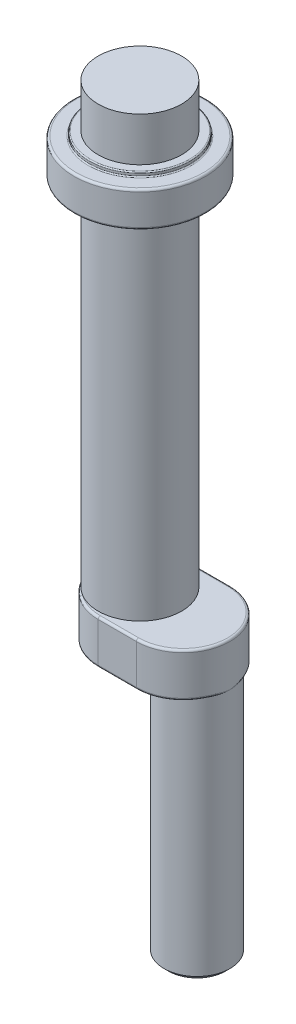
ISO-10303-21;
HEADER;
FILE_DESCRIPTION(('STEP AP214'),'2;1');
FILE_NAME('part.step','',(''),(''),'','','');
FILE_SCHEMA(('AUTOMOTIVE_DESIGN { 1 0 10303 214 1 1 1 1 }'));
ENDSEC;
DATA;
#1=APPLICATION_CONTEXT('core data for automotive mechanical design processes');
#2=APPLICATION_PROTOCOL_DEFINITION('international standard','automotive_design',2000,#1);
#3=PRODUCT_CONTEXT('',#1,'mechanical');
#4=PRODUCT('Part','Part','',(#3));
#5=PRODUCT_RELATED_PRODUCT_CATEGORY('part','',(#4));
#6=PRODUCT_DEFINITION_FORMATION('','',#4);
#7=PRODUCT_DEFINITION_CONTEXT('part definition',#1,'design');
#8=PRODUCT_DEFINITION('design','',#6,#7);
#9=PRODUCT_DEFINITION_SHAPE('','',#8);
#10=(LENGTH_UNIT() NAMED_UNIT(*) SI_UNIT(.MILLI.,.METRE.));
#11=(NAMED_UNIT(*) PLANE_ANGLE_UNIT() SI_UNIT($,.RADIAN.));
#12=(NAMED_UNIT(*) SI_UNIT($,.STERADIAN.) SOLID_ANGLE_UNIT());
#13=UNCERTAINTY_MEASURE_WITH_UNIT(LENGTH_MEASURE(1.E-05),#10,'distance_accuracy_value','');
#14=(GEOMETRIC_REPRESENTATION_CONTEXT(3) GLOBAL_UNCERTAINTY_ASSIGNED_CONTEXT((#13)) GLOBAL_UNIT_ASSIGNED_CONTEXT((#10,
#11,#12)) REPRESENTATION_CONTEXT('',''));
#15=CARTESIAN_POINT('',(0.,0.,0.));
#16=DIRECTION('',(0.,0.,1.));
#17=DIRECTION('',(1.,0.,0.));
#18=AXIS2_PLACEMENT_3D('',#15,#16,#17);
#19=CARTESIAN_POINT('',(-5.49999999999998,95.,-9.5));
#20=DIRECTION('',(0.,1.,0.));
#21=DIRECTION('',(0.,0.,1.));
#22=AXIS2_PLACEMENT_3D('',#19,#20,#21);
#23=PLANE('',#22);
#24=CARTESIAN_POINT('',(-5.49999999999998,95.,0.));
#25=DIRECTION('',(0.,1.,0.));
#26=DIRECTION('',(0.,0.,1.));
#27=AXIS2_PLACEMENT_3D('',#24,#25,#26);
#28=CIRCLE('',#27,11.25);
#29=CARTESIAN_POINT('',(-5.49999999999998,95.,11.25));
#30=VERTEX_POINT('',#29);
#31=EDGE_CURVE('E95',#30,#30,#28,.T.);
#32=ORIENTED_EDGE('',*,*,#31,.T.);
#33=EDGE_LOOP('',(#32));
#34=FACE_BOUND('',#33,.T.);
#35=CARTESIAN_POINT('',(-5.49999999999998,95.,0.));
#36=DIRECTION('',(0.,1.,0.));
#37=DIRECTION('',(0.,0.,1.));
#38=AXIS2_PLACEMENT_3D('',#35,#36,#37);
#39=CIRCLE('',#38,9.5);
#40=CARTESIAN_POINT('',(-5.49999999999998,95.,9.5));
#41=VERTEX_POINT('',#40);
#42=EDGE_CURVE('E11',#41,#41,#39,.T.);
#43=ORIENTED_EDGE('',*,*,#42,.F.);
#44=EDGE_LOOP('',(#43));
#45=FACE_BOUND('',#44,.T.);
#46=ADVANCED_FACE('F49',(#34,#45),#23,.T.);
#47=CARTESIAN_POINT('',(-5.49999999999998,105.,0.));
#48=DIRECTION('',(0.,1.,0.));
#49=DIRECTION('',(0.,0.,1.));
#50=AXIS2_PLACEMENT_3D('',#47,#48,#49);
#51=CYLINDRICAL_SURFACE('',#50,9.5);
#52=ORIENTED_EDGE('',*,*,#42,.T.);
#53=EDGE_LOOP('',(#52));
#54=FACE_BOUND('',#53,.T.);
#55=CARTESIAN_POINT('',(-5.49999999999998,85.,0.));
#56=DIRECTION('',(0.,1.,0.));
#57=DIRECTION('',(0.,0.,1.));
#58=AXIS2_PLACEMENT_3D('',#55,#56,#57);
#59=CIRCLE('',#58,9.5);
#60=CARTESIAN_POINT('',(-5.49999999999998,85.,9.5));
#61=VERTEX_POINT('',#60);
#62=EDGE_CURVE('E55',#61,#61,#59,.T.);
#63=ORIENTED_EDGE('',*,*,#62,.F.);
#64=EDGE_LOOP('',(#63));
#65=FACE_BOUND('',#64,.T.);
#66=ADVANCED_FACE('F113',(#54,#65),#51,.F.);
#67=CARTESIAN_POINT('',(-5.49999999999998,85.,-9.5));
#68=DIRECTION('',(0.,-1.,0.));
#69=DIRECTION('',(0.,0.,-1.));
#70=AXIS2_PLACEMENT_3D('',#67,#68,#69);
#71=PLANE('',#70);
#72=ORIENTED_EDGE('',*,*,#62,.T.);
#73=EDGE_LOOP('',(#72));
#74=FACE_BOUND('',#73,.T.);
#75=CARTESIAN_POINT('',(-5.49999999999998,85.,0.));
#76=DIRECTION('',(0.,1.,0.));
#77=DIRECTION('',(0.,0.,1.));
#78=AXIS2_PLACEMENT_3D('',#75,#76,#77);
#79=CIRCLE('',#78,11.25);
#80=CARTESIAN_POINT('',(-5.49999999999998,85.,11.25));
#81=VERTEX_POINT('',#80);
#82=EDGE_CURVE('E59',#81,#81,#79,.T.);
#83=ORIENTED_EDGE('',*,*,#82,.F.);
#84=EDGE_LOOP('',(#83));
#85=FACE_BOUND('',#84,.T.);
#86=ADVANCED_FACE('F117',(#74,#85),#71,.T.);
#87=CARTESIAN_POINT('',(-5.49999999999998,85.25,0.));
#88=DIRECTION('',(0.,1.,0.));
#89=DIRECTION('',(0.,0.,1.));
#90=AXIS2_PLACEMENT_3D('',#87,#88,#89);
#91=TOROIDAL_SURFACE('',#90,11.25,0.25);
#92=ORIENTED_EDGE('',*,*,#82,.T.);
#93=EDGE_LOOP('',(#92));
#94=FACE_BOUND('',#93,.T.);
#95=CARTESIAN_POINT('',(-5.49999999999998,85.25,0.));
#96=DIRECTION('',(0.,1.,0.));
#97=DIRECTION('',(0.,0.,1.));
#98=AXIS2_PLACEMENT_3D('',#95,#96,#97);
#99=CIRCLE('',#98,11.5);
#100=CARTESIAN_POINT('',(-5.49999999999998,85.25,11.5));
#101=VERTEX_POINT('',#100);
#102=EDGE_CURVE('E63',#101,#101,#99,.T.);
#103=ORIENTED_EDGE('',*,*,#102,.F.);
#104=EDGE_LOOP('',(#103));
#105=FACE_BOUND('',#104,.T.);
#106=ADVANCED_FACE('F121',(#94,#105),#91,.T.);
#107=CARTESIAN_POINT('',(-5.49999999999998,105.,0.));
#108=DIRECTION('',(0.,1.,0.));
#109=DIRECTION('',(0.,0.,1.));
#110=AXIS2_PLACEMENT_3D('',#107,#108,#109);
#111=CYLINDRICAL_SURFACE('',#110,11.5);
#112=ORIENTED_EDGE('',*,*,#102,.T.);
#113=EDGE_LOOP('',(#112));
#114=FACE_BOUND('',#113,.T.);
#115=CARTESIAN_POINT('',(-5.49999999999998,85.75,0.));
#116=DIRECTION('',(0.,1.,0.));
#117=DIRECTION('',(0.,0.,1.));
#118=AXIS2_PLACEMENT_3D('',#115,#116,#117);
#119=CIRCLE('',#118,11.5);
#120=CARTESIAN_POINT('',(-5.49999999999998,85.75,11.5));
#121=VERTEX_POINT('',#120);
#122=EDGE_CURVE('E68',#121,#121,#119,.T.);
#123=ORIENTED_EDGE('',*,*,#122,.F.);
#124=EDGE_LOOP('',(#123));
#125=FACE_BOUND('',#124,.T.);
#126=ADVANCED_FACE('F127',(#114,#125),#111,.T.);
#127=CARTESIAN_POINT('',(-5.49999999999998,85.75,0.));
#128=DIRECTION('',(0.,1.,0.));
#129=DIRECTION('',(0.,0.,1.));
#130=AXIS2_PLACEMENT_3D('',#127,#128,#129);
#131=TOROIDAL_SURFACE('',#130,11.75,0.25);
#132=ORIENTED_EDGE('',*,*,#122,.T.);
#133=EDGE_LOOP('',(#132));
#134=FACE_BOUND('',#133,.T.);
#135=CARTESIAN_POINT('',(-5.49999999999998,86.,0.));
#136=DIRECTION('',(0.,1.,0.));
#137=DIRECTION('',(0.,0.,1.));
#138=AXIS2_PLACEMENT_3D('',#135,#136,#137);
#139=CIRCLE('',#138,11.75);
#140=CARTESIAN_POINT('',(-5.49999999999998,86.,11.75));
#141=VERTEX_POINT('',#140);
#142=EDGE_CURVE('E71',#141,#141,#139,.T.);
#143=ORIENTED_EDGE('',*,*,#142,.F.);
#144=EDGE_LOOP('',(#143));
#145=FACE_BOUND('',#144,.T.);
#146=ADVANCED_FACE('F131',(#134,#145),#131,.F.);
#147=CARTESIAN_POINT('',(-5.49999999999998,86.,-11.75));
#148=DIRECTION('',(0.,-1.,0.));
#149=DIRECTION('',(0.,0.,-1.));
#150=AXIS2_PLACEMENT_3D('',#147,#148,#149);
#151=PLANE('',#150);
#152=ORIENTED_EDGE('',*,*,#142,.T.);
#153=EDGE_LOOP('',(#152));
#154=FACE_BOUND('',#153,.T.);
#155=CARTESIAN_POINT('',(-5.49999999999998,86.,0.));
#156=DIRECTION('',(0.,1.,0.));
#157=DIRECTION('',(0.,0.,1.));
#158=AXIS2_PLACEMENT_3D('',#155,#156,#157);
#159=CIRCLE('',#158,14.5);
#160=CARTESIAN_POINT('',(-5.49999999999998,86.,14.5));
#161=VERTEX_POINT('',#160);
#162=EDGE_CURVE('E74',#161,#161,#159,.T.);
#163=ORIENTED_EDGE('',*,*,#162,.F.);
#164=EDGE_LOOP('',(#163));
#165=FACE_BOUND('',#164,.T.);
#166=ADVANCED_FACE('F135',(#154,#165),#151,.T.);
#167=CARTESIAN_POINT('',(-5.49999999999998,86.5,0.));
#168=DIRECTION('',(0.,1.,0.));
#169=DIRECTION('',(0.,0.,1.));
#170=AXIS2_PLACEMENT_3D('',#167,#168,#169);
#171=TOROIDAL_SURFACE('',#170,14.5,0.5);
#172=ORIENTED_EDGE('',*,*,#162,.T.);
#173=EDGE_LOOP('',(#172));
#174=FACE_BOUND('',#173,.T.);
#175=CARTESIAN_POINT('',(-5.49999999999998,86.5,0.));
#176=DIRECTION('',(0.,1.,0.));
#177=DIRECTION('',(0.,0.,1.));
#178=AXIS2_PLACEMENT_3D('',#175,#176,#177);
#179=CIRCLE('',#178,15.);
#180=CARTESIAN_POINT('',(-5.49999999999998,86.5,15.));
#181=VERTEX_POINT('',#180);
#182=EDGE_CURVE('E77',#181,#181,#179,.T.);
#183=ORIENTED_EDGE('',*,*,#182,.F.);
#184=EDGE_LOOP('',(#183));
#185=FACE_BOUND('',#184,.T.);
#186=ADVANCED_FACE('F139',(#174,#185),#171,.T.);
#187=CARTESIAN_POINT('',(-5.49999999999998,105.,0.));
#188=DIRECTION('',(0.,1.,0.));
#189=DIRECTION('',(0.,0.,1.));
#190=AXIS2_PLACEMENT_3D('',#187,#188,#189);
#191=CYLINDRICAL_SURFACE('',#190,15.);
#192=ORIENTED_EDGE('',*,*,#182,.T.);
#193=EDGE_LOOP('',(#192));
#194=FACE_BOUND('',#193,.T.);
#195=CARTESIAN_POINT('',(-5.49999999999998,93.5,0.));
#196=DIRECTION('',(0.,1.,0.));
#197=DIRECTION('',(0.,0.,1.));
#198=AXIS2_PLACEMENT_3D('',#195,#196,#197);
#199=CIRCLE('',#198,15.);
#200=CARTESIAN_POINT('',(-5.49999999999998,93.5,15.));
#201=VERTEX_POINT('',#200);
#202=EDGE_CURVE('E80',#201,#201,#199,.T.);
#203=ORIENTED_EDGE('',*,*,#202,.F.);
#204=EDGE_LOOP('',(#203));
#205=FACE_BOUND('',#204,.T.);
#206=ADVANCED_FACE('F143',(#194,#205),#191,.T.);
#207=CARTESIAN_POINT('',(-5.49999999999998,93.5,0.));
#208=DIRECTION('',(0.,1.,0.));
#209=DIRECTION('',(0.,0.,1.));
#210=AXIS2_PLACEMENT_3D('',#207,#208,#209);
#211=TOROIDAL_SURFACE('',#210,14.5,0.5);
#212=ORIENTED_EDGE('',*,*,#202,.T.);
#213=EDGE_LOOP('',(#212));
#214=FACE_BOUND('',#213,.T.);
#215=CARTESIAN_POINT('',(-5.49999999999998,94.,0.));
#216=DIRECTION('',(0.,1.,0.));
#217=DIRECTION('',(0.,0.,1.));
#218=AXIS2_PLACEMENT_3D('',#215,#216,#217);
#219=CIRCLE('',#218,14.5);
#220=CARTESIAN_POINT('',(-5.49999999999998,94.,14.5));
#221=VERTEX_POINT('',#220);
#222=EDGE_CURVE('E83',#221,#221,#219,.T.);
#223=ORIENTED_EDGE('',*,*,#222,.F.);
#224=EDGE_LOOP('',(#223));
#225=FACE_BOUND('',#224,.T.);
#226=ADVANCED_FACE('F147',(#214,#225),#211,.T.);
#227=CARTESIAN_POINT('',(-5.49999999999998,94.,-11.75));
#228=DIRECTION('',(0.,1.,0.));
#229=DIRECTION('',(0.,0.,1.));
#230=AXIS2_PLACEMENT_3D('',#227,#228,#229);
#231=PLANE('',#230);
#232=ORIENTED_EDGE('',*,*,#222,.T.);
#233=EDGE_LOOP('',(#232));
#234=FACE_BOUND('',#233,.T.);
#235=CARTESIAN_POINT('',(-5.49999999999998,94.,0.));
#236=DIRECTION('',(0.,1.,0.));
#237=DIRECTION('',(0.,0.,1.));
#238=AXIS2_PLACEMENT_3D('',#235,#236,#237);
#239=CIRCLE('',#238,11.75);
#240=CARTESIAN_POINT('',(-5.49999999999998,94.,11.75));
#241=VERTEX_POINT('',#240);
#242=EDGE_CURVE('E86',#241,#241,#239,.T.);
#243=ORIENTED_EDGE('',*,*,#242,.F.);
#244=EDGE_LOOP('',(#243));
#245=FACE_BOUND('',#244,.T.);
#246=ADVANCED_FACE('F151',(#234,#245),#231,.T.);
#247=CARTESIAN_POINT('',(-5.49999999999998,94.25,0.));
#248=DIRECTION('',(0.,1.,0.));
#249=DIRECTION('',(0.,0.,1.));
#250=AXIS2_PLACEMENT_3D('',#247,#248,#249);
#251=TOROIDAL_SURFACE('',#250,11.75,0.25);
#252=ORIENTED_EDGE('',*,*,#242,.T.);
#253=EDGE_LOOP('',(#252));
#254=FACE_BOUND('',#253,.T.);
#255=CARTESIAN_POINT('',(-5.49999999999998,94.25,0.));
#256=DIRECTION('',(0.,1.,0.));
#257=DIRECTION('',(0.,0.,1.));
#258=AXIS2_PLACEMENT_3D('',#255,#256,#257);
#259=CIRCLE('',#258,11.5);
#260=CARTESIAN_POINT('',(-5.49999999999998,94.25,11.5));
#261=VERTEX_POINT('',#260);
#262=EDGE_CURVE('E89',#261,#261,#259,.T.);
#263=ORIENTED_EDGE('',*,*,#262,.F.);
#264=EDGE_LOOP('',(#263));
#265=FACE_BOUND('',#264,.T.);
#266=ADVANCED_FACE('F109',(#254,#265),#251,.F.);
#267=CARTESIAN_POINT('',(-5.49999999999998,105.,0.));
#268=DIRECTION('',(0.,1.,0.));
#269=DIRECTION('',(0.,0.,1.));
#270=AXIS2_PLACEMENT_3D('',#267,#268,#269);
#271=CYLINDRICAL_SURFACE('',#270,11.5);
#272=ORIENTED_EDGE('',*,*,#262,.T.);
#273=EDGE_LOOP('',(#272));
#274=FACE_BOUND('',#273,.T.);
#275=CARTESIAN_POINT('',(-5.49999999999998,94.75,0.));
#276=DIRECTION('',(0.,1.,0.));
#277=DIRECTION('',(0.,0.,1.));
#278=AXIS2_PLACEMENT_3D('',#275,#276,#277);
#279=CIRCLE('',#278,11.5);
#280=CARTESIAN_POINT('',(-5.49999999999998,94.75,11.5));
#281=VERTEX_POINT('',#280);
#282=EDGE_CURVE('E92',#281,#281,#279,.T.);
#283=ORIENTED_EDGE('',*,*,#282,.F.);
#284=EDGE_LOOP('',(#283));
#285=FACE_BOUND('',#284,.T.);
#286=ADVANCED_FACE('F103',(#274,#285),#271,.T.);
#287=CARTESIAN_POINT('',(-5.49999999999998,94.75,0.));
#288=DIRECTION('',(0.,1.,0.));
#289=DIRECTION('',(0.,0.,1.));
#290=AXIS2_PLACEMENT_3D('',#287,#288,#289);
#291=TOROIDAL_SURFACE('',#290,11.25,0.25);
#292=ORIENTED_EDGE('',*,*,#282,.T.);
#293=EDGE_LOOP('',(#292));
#294=FACE_BOUND('',#293,.T.);
#295=ORIENTED_EDGE('',*,*,#31,.F.);
#296=EDGE_LOOP('',(#295));
#297=FACE_BOUND('',#296,.T.);
#298=ADVANCED_FACE('F101',(#294,#297),#291,.T.);
#299=CLOSED_SHELL('',(#46,#66,#86,#106,#126,#146,#166,#186,#206,#226,#246,#266,#286,#298));
#300=MANIFOLD_SOLID_BREP('B2',#299);
#301=CARTESIAN_POINT('',(-4.3568347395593,5.,0.));
#302=DIRECTION('',(0.,-1.,0.));
#303=DIRECTION('',(0.,0.,-1.));
#304=AXIS2_PLACEMENT_3D('',#301,#302,#303);
#305=CYLINDRICAL_SURFACE('',#304,10.6431652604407);
#306=DIRECTION('',(0.,-1.,0.));
#307=VECTOR('',#306,1.);
#308=CARTESIAN_POINT('',(-4.3568347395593,5.,-10.6431652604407));
#309=LINE('',#308,#307);
#310=CARTESIAN_POINT('',(-4.3568347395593,4.5,-10.6431652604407));
#311=VERTEX_POINT('',#310);
#312=CARTESIAN_POINT('',(-4.3568347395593,-4.5,-10.6431652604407));
#313=VERTEX_POINT('',#312);
#314=EDGE_CURVE('E395',#311,#313,#309,.T.);
#315=ORIENTED_EDGE('',*,*,#314,.T.);
#316=CARTESIAN_POINT('',(-4.3568347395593,-4.5,0.));
#317=DIRECTION('',(0.,-1.,0.));
#318=DIRECTION('',(0.,0.,-1.));
#319=AXIS2_PLACEMENT_3D('',#316,#317,#318);
#320=CIRCLE('',#319,10.6431652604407);
#321=CARTESIAN_POINT('',(-4.3568347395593,-4.5,10.6431652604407));
#322=VERTEX_POINT('',#321);
#323=EDGE_CURVE('E632',#313,#322,#320,.F.);
#324=ORIENTED_EDGE('',*,*,#323,.T.);
#325=DIRECTION('',(0.,-1.,0.));
#326=VECTOR('',#325,1.);
#327=CARTESIAN_POINT('',(-4.3568347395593,5.,10.6431652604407));
#328=LINE('',#327,#326);
#329=CARTESIAN_POINT('',(-4.3568347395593,4.5,10.6431652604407));
#330=VERTEX_POINT('',#329);
#331=EDGE_CURVE('E398',#330,#322,#328,.T.);
#332=ORIENTED_EDGE('',*,*,#331,.F.);
#333=CARTESIAN_POINT('',(-4.3568347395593,4.5,0.));
#334=DIRECTION('',(0.,-1.,0.));
#335=DIRECTION('',(0.,0.,-1.));
#336=AXIS2_PLACEMENT_3D('',#333,#334,#335);
#337=CIRCLE('',#336,10.6431652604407);
#338=CARTESIAN_POINT('',(-10.7547817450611,4.5,8.50548298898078));
#339=VERTEX_POINT('',#338);
#340=EDGE_CURVE('E633',#330,#339,#337,.T.);
#341=ORIENTED_EDGE('',*,*,#340,.T.);
#342=CARTESIAN_POINT('',(-7.18734188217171,5.,9.34895060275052));
#343=CARTESIAN_POINT('',(-7.28410371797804,5.25730088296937,9.55850646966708));
#344=CARTESIAN_POINT('',(-7.36165410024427,5.13618012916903,9.87282471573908));
#345=CARTESIAN_POINT('',(-7.43920448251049,5.01505937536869,10.1871429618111));
#346=CARTESIAN_POINT('',(-7.39723234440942,4.67218612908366,10.1996543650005));
#347=CARTESIAN_POINT('',(-7.24737761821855,5.,9.33811538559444));
#348=CARTESIAN_POINT('',(-7.343754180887,5.24976797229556,9.55057746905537));
#349=CARTESIAN_POINT('',(-7.42247973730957,5.12650383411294,9.85949316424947));
#350=CARTESIAN_POINT('',(-7.5007703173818,5.00330580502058,10.1685070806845));
#351=CARTESIAN_POINT('',(-7.46141185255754,4.66404313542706,10.1805235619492));
#352=CARTESIAN_POINT('',(-7.30743322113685,5.,9.32667880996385));
#353=CARTESIAN_POINT('',(-7.40388161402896,5.24246184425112,9.54155869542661));
#354=CARTESIAN_POINT('',(-7.48350577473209,5.11728176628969,9.84529967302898));
#355=CARTESIAN_POINT('',(-7.56272449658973,4.99215948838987,10.1491408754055));
#356=CARTESIAN_POINT('',(-7.52547297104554,4.65641928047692,10.1607677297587));
#357=CARTESIAN_POINT('',(-7.42753435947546,5.,9.3025996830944));
#358=CARTESIAN_POINT('',(-7.52442211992,5.22831713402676,9.52154544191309));
#359=CARTESIAN_POINT('',(-7.60577755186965,5.09962815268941,9.81528149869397));
#360=CARTESIAN_POINT('',(-7.68672551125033,4.9709987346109,10.1091169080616));
#361=CARTESIAN_POINT('',(-7.65330659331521,4.64206096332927,10.1200167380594));
#362=CARTESIAN_POINT('',(-7.48757989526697,5.,9.28995719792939));
#363=CARTESIAN_POINT('',(-7.58486706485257,5.22147147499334,9.51055851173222));
#364=CARTESIAN_POINT('',(-7.66702327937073,5.09119656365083,9.79945690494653));
#365=CARTESIAN_POINT('',(-7.74880647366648,4.96097083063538,10.0884565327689));
#366=CARTESIAN_POINT('',(-7.71707911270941,4.63532645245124,10.0990216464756));
#367=CARTESIAN_POINT('',(-7.66761026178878,5.,9.25021992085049));
#368=CARTESIAN_POINT('',(-7.76578762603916,5.2016227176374,9.4749784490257));
#369=CARTESIAN_POINT('',(-7.85080155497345,5.06691267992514,9.74968042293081));
#370=CARTESIAN_POINT('',(-7.93433363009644,4.93239867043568,10.0247833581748));
#371=CARTESIAN_POINT('',(-7.90786866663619,4.61623518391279,10.0341998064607));
#372=CARTESIAN_POINT('',(-7.78751521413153,5.,9.22131056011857));
#373=CARTESIAN_POINT('',(-7.88713225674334,5.18915151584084,9.44757894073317));
#374=CARTESIAN_POINT('',(-7.97340202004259,5.05206713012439,9.71341990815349));
#375=CARTESIAN_POINT('',(-8.0583870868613,4.91512835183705,9.97967128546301));
#376=CARTESIAN_POINT('',(-8.03438587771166,4.60498725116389,9.98852809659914));
#377=CARTESIAN_POINT('',(-8.02673530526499,5.,9.15865113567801));
#378=CARTESIAN_POINT('',(-8.12931410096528,5.16560451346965,9.38621667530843));
#379=CARTESIAN_POINT('',(-8.21791693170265,5.0244824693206,9.63519090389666));
#380=CARTESIAN_POINT('',(-8.30525416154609,4.88350253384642,9.88457064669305));
#381=CARTESIAN_POINT('',(-8.28570737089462,4.58476645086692,9.89237189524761));
#382=CARTESIAN_POINT('',(-8.14605068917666,5.,9.12490329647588));
#383=CARTESIAN_POINT('',(-8.25030865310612,5.15449891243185,9.35228615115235));
#384=CARTESIAN_POINT('',(-8.33983166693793,5.01174239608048,9.59322503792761));
#385=CARTESIAN_POINT('',(-8.42823594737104,4.86909579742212,9.83457498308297));
#386=CARTESIAN_POINT('',(-8.41051241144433,4.57579254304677,9.8418896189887));
#387=CARTESIAN_POINT('',(-8.38389146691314,5.,9.05254811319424));
#388=CARTESIAN_POINT('',(-8.49138223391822,5.133473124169,9.27829472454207));
#389=CARTESIAN_POINT('',(-8.5825443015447,4.98799457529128,9.50384112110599));
#390=CARTESIAN_POINT('',(-8.67260195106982,4.84262363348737,9.72979517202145));
#391=CARTESIAN_POINT('',(-8.65822753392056,4.55970344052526,9.73617628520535));
#392=CARTESIAN_POINT('',(-8.50241682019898,5.,9.01394052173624));
#393=CARTESIAN_POINT('',(-8.61158612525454,5.12353206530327,9.23825338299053));
#394=CARTESIAN_POINT('',(-8.70334214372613,4.9769869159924,9.45642279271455));
#395=CARTESIAN_POINT('',(-8.79411878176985,4.83052426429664,9.67500357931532));
#396=CARTESIAN_POINT('',(-8.78113751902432,4.5525883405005,9.68094498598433));
#397=CARTESIAN_POINT('',(-8.85606740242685,5.,8.89095124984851));
#398=CARTESIAN_POINT('',(-8.96840605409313,5.09541048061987,9.11006333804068));
#399=CARTESIAN_POINT('',(-9.06310509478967,4.94619739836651,9.30645525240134));
#400=CARTESIAN_POINT('',(-9.15390940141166,4.79732024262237,9.50446453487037));
#401=CARTESIAN_POINT('',(-9.14630306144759,4.53361544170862,9.50843462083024));
#402=CARTESIAN_POINT('',(-9.08969044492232,5.,8.79929267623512));
#403=CARTESIAN_POINT('',(-9.2051653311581,5.07857091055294,9.01277445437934));
#404=CARTESIAN_POINT('',(-9.29987339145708,4.92860244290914,9.19605405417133));
#405=CARTESIAN_POINT('',(-9.39142478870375,4.77884479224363,9.38095935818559));
#406=CARTESIAN_POINT('',(-9.38543868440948,4.5240966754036,9.38416904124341));
#407=CARTESIAN_POINT('',(-9.55098423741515,5.,8.59668646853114));
#408=CARTESIAN_POINT('',(-9.6708229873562,5.04830501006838,8.79671061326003));
#409=CARTESIAN_POINT('',(-9.7651675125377,4.89796678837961,8.95557642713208));
#410=CARTESIAN_POINT('',(-9.85642368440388,4.74782897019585,9.1160440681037));
#411=CARTESIAN_POINT('',(-9.8537054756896,4.50992202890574,9.11778355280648));
#412=CARTESIAN_POINT('',(-9.77865428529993,5.,8.48573657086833));
#413=CARTESIAN_POINT('',(-9.90031198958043,5.034802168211,8.67799174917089));
#414=CARTESIAN_POINT('',(-9.99369236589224,4.88492662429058,8.82549768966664));
#415=CARTESIAN_POINT('',(-10.084525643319,4.73517817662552,8.97459187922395));
#416=CARTESIAN_POINT('',(-10.0828354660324,4.50526671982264,8.97566154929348));
#417=CARTESIAN_POINT('',(-10.2258502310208,5.,8.24504041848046));
#418=CARTESIAN_POINT('',(-10.3492057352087,5.01073147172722,8.42063449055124));
#419=CARTESIAN_POINT('',(-10.440283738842,4.86265525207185,8.54698850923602));
#420=CARTESIAN_POINT('',(-10.5288542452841,4.71470400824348,8.67490648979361));
#421=CARTESIAN_POINT('',(-10.5292845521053,4.50001488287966,8.67468524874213));
#422=CARTESIAN_POINT('',(-10.4453901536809,5.,8.11532862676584));
#423=CARTESIAN_POINT('',(-10.5690891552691,5.0001069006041,8.28205495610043));
#424=CARTESIAN_POINT('',(-10.6583684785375,4.85341717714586,8.39859178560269));
#425=CARTESIAN_POINT('',(-10.7455792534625,4.70680216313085,8.51665864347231));
#426=CARTESIAN_POINT('',(-10.7466243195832,4.49941100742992,8.51586177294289));
#427=CARTESIAN_POINT('',(-10.8749664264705,5.,7.83742160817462));
#428=CARTESIAN_POINT('',(-10.9974940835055,4.98140314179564,7.98606266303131));
#429=CARTESIAN_POINT('',(-11.0828898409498,4.83817887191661,8.0843442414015));
#430=CARTESIAN_POINT('',(-11.1662415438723,4.69502751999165,8.18414009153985));
#431=CARTESIAN_POINT('',(-11.1686209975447,4.50167446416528,8.18222980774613));
#432=CARTESIAN_POINT('',(-11.0850032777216,5.,7.68922735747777));
#433=CARTESIAN_POINT('',(-11.2064010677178,4.97328734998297,7.82864104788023));
#434=CARTESIAN_POINT('',(-11.2893270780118,4.83217847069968,7.91849434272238));
#435=CARTESIAN_POINT('',(-11.370573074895,4.69110826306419,8.00980989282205));
#436=CARTESIAN_POINT('',(-11.3732785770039,4.50454161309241,8.00742216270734));
#437=CARTESIAN_POINT('',(-11.4938803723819,5.,7.37495046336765));
#438=CARTESIAN_POINT('',(-11.6113439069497,4.95931612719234,7.4961507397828));
#439=CARTESIAN_POINT('',(-11.6891517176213,4.82300652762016,7.5704099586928));
#440=CARTESIAN_POINT('',(-11.7652942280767,4.6867349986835,7.6461193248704));
#441=CARTESIAN_POINT('',(-11.7687703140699,4.51331715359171,7.64280897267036));
#442=CARTESIAN_POINT('',(-11.6927182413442,5.,7.20886404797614));
#443=CARTESIAN_POINT('',(-11.8077054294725,4.95343476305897,7.32104296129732));
#444=CARTESIAN_POINT('',(-11.8825363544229,4.81983558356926,7.38817201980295));
#445=CARTESIAN_POINT('',(-11.956012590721,4.686250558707,7.45668162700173));
#446=CARTESIAN_POINT('',(-11.9596015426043,4.51922618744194,7.45300026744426));
#447=CARTESIAN_POINT('',(-12.0774337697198,5.,6.85965462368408));
#448=CARTESIAN_POINT('',(-12.1860505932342,4.94369363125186,6.95448913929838));
#449=CARTESIAN_POINT('',(-12.254872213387,4.81598933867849,7.00852615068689));
#450=CARTESIAN_POINT('',(-12.3223502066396,4.68829876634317,7.06393389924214));
#451=CARTESIAN_POINT('',(-12.3262925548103,4.53372962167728,7.05953526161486));
#452=CARTESIAN_POINT('',(-12.2633109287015,5.,6.67653095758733));
#453=CARTESIAN_POINT('',(-12.3683177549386,4.93981474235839,6.7629850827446));
#454=CARTESIAN_POINT('',(-12.4338228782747,4.81531413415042,6.81111763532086));
#455=CARTESIAN_POINT('',(-12.4982524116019,4.69081079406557,6.86053570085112));
#456=CARTESIAN_POINT('',(-12.5021517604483,4.54232412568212,6.85587842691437));
#457=CARTESIAN_POINT('',(-12.6379161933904,5.,6.27555518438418));
#458=CARTESIAN_POINT('',(-12.7340758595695,4.93357168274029,6.34564069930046));
#459=CARTESIAN_POINT('',(-12.7928126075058,4.81620872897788,6.38238884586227));
#460=CARTESIAN_POINT('',(-12.850260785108,4.69884262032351,6.42067482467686));
#461=CARTESIAN_POINT('',(-12.854319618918,4.56284373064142,6.41535741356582));
#462=CARTESIAN_POINT('',(-12.8251453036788,5.,6.05605818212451));
#463=CARTESIAN_POINT('',(-12.91637825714,4.93137327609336,6.11803596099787));
#464=CARTESIAN_POINT('',(-12.9712465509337,4.81800454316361,6.1496401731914));
#465=CARTESIAN_POINT('',(-13.0251308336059,4.70461871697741,6.1826485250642));
#466=CARTESIAN_POINT('',(-13.0289902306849,4.57501235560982,6.17719348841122));
#467=CARTESIAN_POINT('',(-13.1798184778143,5.,5.59945819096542));
#468=CARTESIAN_POINT('',(-13.2602978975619,4.92888098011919,5.64677509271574));
#469=CARTESIAN_POINT('',(-13.3077156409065,4.82389708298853,5.6692514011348));
#470=CARTESIAN_POINT('',(-13.3541567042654,4.71889594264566,5.69312291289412));
#471=CARTESIAN_POINT('',(-13.3578141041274,4.60182582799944,5.68738283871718));
#472=CARTESIAN_POINT('',(-13.347269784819,5.,5.36236169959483));
#473=CARTESIAN_POINT('',(-13.4222033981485,4.92857419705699,5.40299735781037));
#474=CARTESIAN_POINT('',(-13.4657582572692,4.82799296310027,5.42161680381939));
#475=CARTESIAN_POINT('',(-13.5085939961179,4.72738696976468,5.44147757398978));
#476=CARTESIAN_POINT('',(-13.5119748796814,4.61646976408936,5.43574109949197));
#477=CARTESIAN_POINT('',(-13.660757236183,5.,4.87204453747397));
#478=CARTESIAN_POINT('',(-13.7241774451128,4.9295992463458,4.90101107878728));
#479=CARTESIAN_POINT('',(-13.7604415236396,4.83815842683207,4.91291954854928));
#480=CARTESIAN_POINT('',(-13.7959882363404,4.74669281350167,4.9260664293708));
#481=CARTESIAN_POINT('',(-13.7990124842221,4.64789959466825,4.92030228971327));
#482=CARTESIAN_POINT('',(-13.8067649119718,5.,4.61880306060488));
#483=CARTESIAN_POINT('',(-13.8644575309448,4.9309257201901,4.64263087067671));
#484=CARTESIAN_POINT('',(-13.8970537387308,4.84423060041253,4.6518396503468));
#485=CARTESIAN_POINT('',(-13.9291489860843,4.75750795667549,4.66211480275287));
#486=CARTESIAN_POINT('',(-13.931861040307,4.66468828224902,4.65648966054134));
#487=CARTESIAN_POINT('',(-14.0753240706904,5.,4.09871215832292));
#488=CARTESIAN_POINT('',(-14.1216330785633,4.93495635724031,4.11397865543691));
#489=CARTESIAN_POINT('',(-14.1474736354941,4.85801945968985,4.11863442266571));
#490=CARTESIAN_POINT('',(-14.1728157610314,4.78105505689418,4.12435176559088));
#491=CARTESIAN_POINT('',(-14.1750962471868,4.70003578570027,4.11894508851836));
#492=CARTESIAN_POINT('',(-14.1978837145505,5.,3.831867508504));
#493=CARTESIAN_POINT('',(-14.2387358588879,4.93765623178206,3.84353961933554));
#494=CARTESIAN_POINT('',(-14.2612892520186,4.86573557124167,3.84651297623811));
#495=CARTESIAN_POINT('',(-14.2835203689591,4.79378845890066,3.8503607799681));
#496=CARTESIAN_POINT('',(-14.2854907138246,4.7185939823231,3.84521663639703));
#497=CARTESIAN_POINT('',(-14.4196238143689,5.,3.28314790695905));
#498=CARTESIAN_POINT('',(-14.4500068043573,4.94421251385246,3.28920378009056));
#499=CARTESIAN_POINT('',(-14.4666453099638,4.88260640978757,3.28944284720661));
#500=CARTESIAN_POINT('',(-14.4829535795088,4.82097315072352,3.29057753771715));
#501=CARTESIAN_POINT('',(-14.4844900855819,4.75740135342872,3.28586037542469));
#502=CARTESIAN_POINT('',(-14.5184637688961,5.,3.00111793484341));
#503=CARTESIAN_POINT('',(-14.5440116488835,4.94808335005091,3.00496706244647));
#504=CARTESIAN_POINT('',(-14.557861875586,4.89177926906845,3.0043700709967));
#505=CARTESIAN_POINT('',(-14.5715246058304,4.83545215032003,3.00446069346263));
#506=CARTESIAN_POINT('',(-14.5727783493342,4.77767008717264,3.00012138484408));
#507=CARTESIAN_POINT('',(-14.6892965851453,5.,2.42819720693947));
#508=CARTESIAN_POINT('',(-14.706115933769,4.95668747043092,2.42904393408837));
#509=CARTESIAN_POINT('',(-14.7151984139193,4.91114864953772,2.4272432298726));
#510=CARTESIAN_POINT('',(-14.7240939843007,4.86558677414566,2.42612827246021));
#511=CARTESIAN_POINT('',(-14.7249610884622,4.81930791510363,2.42241778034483));
#512=CARTESIAN_POINT('',(-14.7612994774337,5.,2.13730980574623));
#513=CARTESIAN_POINT('',(-14.7743505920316,4.96142178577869,2.1371503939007));
#514=CARTESIAN_POINT('',(-14.7813277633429,4.92134478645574,2.13519181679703));
#515=CARTESIAN_POINT('',(-14.7882201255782,4.88125107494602,2.13370090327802));
#516=CARTESIAN_POINT('',(-14.7888646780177,4.84067659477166,2.13045553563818));
#517=CARTESIAN_POINT('',(-14.8774507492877,5.,1.55009990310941));
#518=CARTESIAN_POINT('',(-14.8842357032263,4.97146026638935,1.54901046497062));
#519=CARTESIAN_POINT('',(-14.8878702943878,4.94240426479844,1.54698334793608));
#520=CARTESIAN_POINT('',(-14.8914207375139,4.9133315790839,1.54542135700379));
#521=CARTESIAN_POINT('',(-14.891778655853,4.8841091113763,1.54294544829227));
#522=CARTESIAN_POINT('',(-14.9216625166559,5.,1.2537913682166));
#523=CARTESIAN_POINT('',(-14.9260306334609,4.97676604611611,1.25255731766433));
#524=CARTESIAN_POINT('',(-14.9283419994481,4.95326602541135,1.25083722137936));
#525=CARTESIAN_POINT('',(-14.9306312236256,4.92975707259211,1.24935878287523));
#526=CARTESIAN_POINT('',(-14.9308456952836,4.90617124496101,1.24740734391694));
#527=CARTESIAN_POINT('',(-14.9818966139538,5.,0.658132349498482));
#528=CARTESIAN_POINT('',(-14.9829090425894,4.98767228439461,0.657293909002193));
#529=CARTESIAN_POINT('',(-14.9834557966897,4.97534033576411,0.65620549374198));
#530=CARTESIAN_POINT('',(-14.9839799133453,4.96299938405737,0.655358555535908));
#531=CARTESIAN_POINT('',(-14.9840387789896,4.95066910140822,0.654262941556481));
#532=CARTESIAN_POINT('',(-14.9979385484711,5.,0.358784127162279));
#533=CARTESIAN_POINT('',(-14.9980544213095,4.99327644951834,0.3582606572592));
#534=CARTESIAN_POINT('',(-14.9981158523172,4.98655263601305,0.357721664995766));
#535=CARTESIAN_POINT('',(-14.9981762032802,4.97982826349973,0.357197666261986));
#536=CARTESIAN_POINT('',(-14.9981821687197,4.97310455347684,0.35665822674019));
#537=CARTESIAN_POINT('',(-14.9999380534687,5.,0.0396472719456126));
#538=CARTESIAN_POINT('',(-14.9999415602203,4.99925697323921,0.039588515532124));
#539=CARTESIAN_POINT('',(-14.9999433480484,4.99851394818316,0.03952969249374));
#540=CARTESIAN_POINT('',(-14.9999452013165,4.99777092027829,0.0394709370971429));
#541=CARTESIAN_POINT('',(-14.9999453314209,4.99702789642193,0.0394121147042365));
#542=CARTESIAN_POINT('',(-15.0000001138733,5.,0.0198233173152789));
#543=CARTESIAN_POINT('',(-15.0000001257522,4.99962849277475,0.0197939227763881));
#544=CARTESIAN_POINT('',(-15.0000000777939,4.99925698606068,0.0197645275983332));
#545=CARTESIAN_POINT('',(-15.0000001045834,4.99888547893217,0.0197351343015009));
#546=CARTESIAN_POINT('',(-15.0000000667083,4.99851397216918,0.019705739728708));
#547=CARTESIAN_POINT('',(-15.,5.,0.));
#548=CARTESIAN_POINT('',(-15.,5.,0.));
#549=CARTESIAN_POINT('',(-15.,5.,0.));
#550=CARTESIAN_POINT('',(-15.,5.,0.));
#551=CARTESIAN_POINT('',(-15.,5.,0.));
#552=(BOUNDED_SURFACE() B_SPLINE_SURFACE(3,2,((#342,#343,#344,#345,#346),(#347,#348,#349,#350,
#351),(#352,#353,#354,#355,#356),(#357,#358,#359,#360,#361),(#362,#363,#364,#365,#366),(#367,
#368,#369,#370,#371),(#372,#373,#374,#375,#376),(#377,#378,#379,#380,#381),(#382,#383,#384,#385,
#386),(#387,#388,#389,#390,#391),(#392,#393,#394,#395,#396),(#397,#398,#399,#400,#401),(#402,
#403,#404,#405,#406),(#407,#408,#409,#410,#411),(#412,#413,#414,#415,#416),(#417,#418,#419,#420,
#421),(#422,#423,#424,#425,#426),(#427,#428,#429,#430,#431),(#432,#433,#434,#435,#436),(#437,
#438,#439,#440,#441),(#442,#443,#444,#445,#446),(#447,#448,#449,#450,#451),(#452,#453,#454,#455,
#456),(#457,#458,#459,#460,#461),(#462,#463,#464,#465,#466),(#467,#468,#469,#470,#471),(#472,
#473,#474,#475,#476),(#477,#478,#479,#480,#481),(#482,#483,#484,#485,#486),(#487,#488,#489,#490,
#491),(#492,#493,#494,#495,#496),(#497,#498,#499,#500,#501),(#502,#503,#504,#505,#506),(#507,
#508,#509,#510,#511),(#512,#513,#514,#515,#516),(#517,#518,#519,#520,#521),(#522,#523,#524,#525,
#526),(#527,#528,#529,#530,#531),(#532,#533,#534,#535,#536),(#537,#538,#539,#540,#541),(#542,
#543,#544,#545,#546),(#547,#548,#549,#550,#551)),.UNSPECIFIED.,.F.,.F.,
.F.) B_SPLINE_SURFACE_WITH_KNOTS((4,2,2,2,2,2,2,2,2,2,2,2,2,2,2,2,2,2,2,2,4),(3,2,3),(0.,
0.193011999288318,0.386013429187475,0.771931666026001,1.15767304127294,1.5434340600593,
2.31359572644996,3.08384782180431,3.85270262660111,4.62151684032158,5.39049345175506,
6.15949973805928,7.00371329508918,7.84761671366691,8.69263056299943,9.5373497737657,
10.3935532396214,11.2494363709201,12.1033601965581,12.956689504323,13.0132072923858),(0.,0.5,
1.),.UNSPECIFIED.) GEOMETRIC_REPRESENTATION_ITEM() RATIONAL_B_SPLINE_SURFACE(((1.,
0.822572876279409,1.,0.822572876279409,1.),(1.,0.825593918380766,1.,0.825593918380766,1.),(1.,
0.828474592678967,1.,0.828474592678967,1.),(1.,0.834001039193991,1.,0.834001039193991,1.),(1.,
0.836646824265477,1.,0.836646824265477,1.),(1.,0.844299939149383,1.,0.844299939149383,1.),(1.,
0.84902431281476,1.,0.84902431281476,1.),(1.,0.857925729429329,1.,0.857925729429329,1.),(1.,
0.862103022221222,1.,0.862103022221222,1.),(1.,0.870035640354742,1.,0.870035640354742,1.),(1.,
0.873790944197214,1.,0.873790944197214,1.),(1.,0.884540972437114,1.,0.884540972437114,1.),(1.,
0.891034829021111,1.,0.891034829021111,1.),(1.,0.903073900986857,1.,0.903073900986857,1.),(1.,
0.908619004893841,1.,0.908619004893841,1.),(1.,0.918960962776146,1.,0.918960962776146,1.),(1.,
0.92375915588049,1.,0.92375915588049,1.),(1.,0.932751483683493,1.,0.932751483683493,1.),(1.,
0.936945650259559,1.,0.936945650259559,1.),(1.,0.944817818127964,1.,0.944817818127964,1.),(1.,
0.948495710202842,1.,0.948495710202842,1.),(1.,0.95539434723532,1.,0.95539434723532,1.),(1.,
0.9586150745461,1.,0.9586150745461,1.),(1.,0.964936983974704,1.,0.964936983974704,1.),(1.,
0.967995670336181,1.,0.967995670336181,1.),(1.,0.97365284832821,1.,0.97365284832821,1.),(1.,
0.976251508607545,1.,0.976251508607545,1.),(1.,0.981022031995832,1.,0.981022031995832,1.),(1.,
0.983193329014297,1.,0.983193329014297,1.),(1.,0.987124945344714,1.,0.987124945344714,1.),(1.,
0.988885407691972,1.,0.988885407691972,1.),(1.,0.992032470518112,1.,0.992032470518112,1.),(1.,
0.993413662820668,1.,0.993413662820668,1.),(1.,0.995780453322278,1.,0.995780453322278,1.),(1.,
0.996766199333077,1.,0.996766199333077,1.),(1.,0.998348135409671,1.,0.998348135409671,1.),(1.,
0.998945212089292,1.,0.998945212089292,1.),(1.,0.999757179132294,1.,0.999757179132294,1.),(1.,
0.99997233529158,1.,0.99997233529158,1.),(1.,0.99999916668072,1.,0.99999916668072,1.),(1.,
0.999999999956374,1.,0.999999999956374,1.),(1.,1.,1.,1.,1.))) REPRESENTATION_ITEM('') SURFACE());
#553=CARTESIAN_POINT('',(-7.39723234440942,4.67218612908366,10.1996543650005));
#554=CARTESIAN_POINT('',(-7.46141185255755,4.66404313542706,10.1805235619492));
#555=CARTESIAN_POINT('',(-7.52547297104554,4.65641928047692,10.1607677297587));
#556=CARTESIAN_POINT('',(-7.65330659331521,4.64206096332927,10.1200167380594));
#557=CARTESIAN_POINT('',(-7.71707911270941,4.63532645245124,10.0990216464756));
#558=CARTESIAN_POINT('',(-7.90786866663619,4.61623518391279,10.0341998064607));
#559=CARTESIAN_POINT('',(-8.03438587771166,4.60498725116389,9.98852809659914));
#560=CARTESIAN_POINT('',(-8.28570737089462,4.58476645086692,9.89237189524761));
#561=CARTESIAN_POINT('',(-8.41051241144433,4.57579254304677,9.8418896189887));
#562=CARTESIAN_POINT('',(-8.65822753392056,4.55970344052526,9.73617628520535));
#563=CARTESIAN_POINT('',(-8.78113751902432,4.5525883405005,9.68094498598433));
#564=CARTESIAN_POINT('',(-9.14630306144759,4.53361544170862,9.50843462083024));
#565=CARTESIAN_POINT('',(-9.38543868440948,4.5240966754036,9.38416904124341));
#566=CARTESIAN_POINT('',(-9.85370547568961,4.50992202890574,9.11778355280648));
#567=CARTESIAN_POINT('',(-10.0828354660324,4.50526671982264,8.97566154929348));
#568=CARTESIAN_POINT('',(-10.5292845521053,4.50001488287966,8.67468524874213));
#569=CARTESIAN_POINT('',(-10.7466243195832,4.49941100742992,8.51586177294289));
#570=CARTESIAN_POINT('',(-11.1686209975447,4.50167446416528,8.18222980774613));
#571=CARTESIAN_POINT('',(-11.3732785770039,4.50454161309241,8.00742216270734));
#572=CARTESIAN_POINT('',(-11.7687703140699,4.51331715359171,7.64280897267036));
#573=CARTESIAN_POINT('',(-11.9596015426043,4.51922618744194,7.45300026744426));
#574=CARTESIAN_POINT('',(-12.3262925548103,4.53372962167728,7.05953526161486));
#575=CARTESIAN_POINT('',(-12.5021517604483,4.54232412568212,6.85587842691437));
#576=CARTESIAN_POINT('',(-12.854319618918,4.56284373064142,6.41535741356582));
#577=CARTESIAN_POINT('',(-13.0289902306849,4.57501235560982,6.17719348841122));
#578=CARTESIAN_POINT('',(-13.3578141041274,4.60182582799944,5.68738283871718));
#579=CARTESIAN_POINT('',(-13.5119748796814,4.61646976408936,5.43574109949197));
#580=CARTESIAN_POINT('',(-13.7990124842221,4.64789959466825,4.92030228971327));
#581=CARTESIAN_POINT('',(-13.931861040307,4.66468828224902,4.65648966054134));
#582=CARTESIAN_POINT('',(-14.1750962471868,4.70003578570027,4.11894508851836));
#583=CARTESIAN_POINT('',(-14.2854907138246,4.7185939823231,3.84521663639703));
#584=CARTESIAN_POINT('',(-14.4844900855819,4.75740135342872,3.28586037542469));
#585=CARTESIAN_POINT('',(-14.5727783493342,4.77767008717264,3.00012138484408));
#586=CARTESIAN_POINT('',(-14.7249610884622,4.81930791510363,2.42241778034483));
#587=CARTESIAN_POINT('',(-14.7888646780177,4.84067659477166,2.13045553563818));
#588=CARTESIAN_POINT('',(-14.891778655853,4.8841091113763,1.54294544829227));
#589=CARTESIAN_POINT('',(-14.9308456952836,4.90617124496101,1.24740734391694));
#590=CARTESIAN_POINT('',(-14.9840387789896,4.95066910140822,0.654262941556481));
#591=CARTESIAN_POINT('',(-14.9981821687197,4.97310455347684,0.356658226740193));
#592=CARTESIAN_POINT('',(-14.9999453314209,4.99702789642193,0.0394121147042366));
#593=CARTESIAN_POINT('',(-15.0000000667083,4.99851397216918,0.019705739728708));
#594=CARTESIAN_POINT('',(-15.,5.,0.));
#595=B_SPLINE_CURVE_WITH_KNOTS('',3,(#553,#554,#555,#556,#557,#558,#559,#560,#561,#562,#563,
#564,#565,#566,#567,#568,#569,#570,#571,#572,#573,#574,#575,#576,#577,#578,#579,#580,#581,#582,
#583,#584,#585,#586,#587,#588,#589,#590,#591,#592,#593,#594),.UNSPECIFIED.,.F.,.F.,(4,2,2,2,2,2,
2,2,2,2,2,2,2,2,2,2,2,2,2,2,4),(0.,0.193011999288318,0.386013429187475,0.771931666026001,
1.15767304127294,1.5434340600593,2.31359572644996,3.08384782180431,3.85270262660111,
4.62151684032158,5.39049345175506,6.15949973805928,7.00371329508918,7.84761671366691,
8.69263056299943,9.5373497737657,10.3935532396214,11.2494363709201,12.1033601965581,
12.956689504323,13.0132072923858),.UNSPECIFIED.);
#596=CARTESIAN_POINT('',(-15.,5.,0.));
#597=VERTEX_POINT('',#596);
#598=EDGE_CURVE('E429',#339,#597,#595,.T.);
#599=ORIENTED_EDGE('',*,*,#598,.T.);
#600=CARTESIAN_POINT('',(-7.397232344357,4.67218612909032,-10.1996543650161));
#601=CARTESIAN_POINT('',(-7.43920447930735,5.01505937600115,-10.1871429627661));
#602=CARTESIAN_POINT('',(-7.36165409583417,5.1361801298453,-9.87282471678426));
#603=CARTESIAN_POINT('',(-7.284103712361,5.25730088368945,-9.5585064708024));
#604=CARTESIAN_POINT('',(-7.18734187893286,5.,-9.34895060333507));
#605=CARTESIAN_POINT('',(-7.46141185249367,4.6640431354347,-10.1805235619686));
#606=CARTESIAN_POINT('',(-7.50077031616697,5.00330580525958,-10.1685070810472));
#607=CARTESIAN_POINT('',(-7.42247973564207,5.12650383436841,-9.85949316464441));
#608=CARTESIAN_POINT('',(-7.34375417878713,5.24976797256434,-9.55057746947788));
#609=CARTESIAN_POINT('',(-7.24737761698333,5.,-9.33811538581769));
#610=CARTESIAN_POINT('',(-7.52547297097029,4.65641928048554,-10.1607677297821));
#611=CARTESIAN_POINT('',(-7.56272449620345,4.99215948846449,-10.1491408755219));
#612=CARTESIAN_POINT('',(-7.48350577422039,5.11728176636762,-9.8452996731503));
#613=CARTESIAN_POINT('',(-7.40388161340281,5.24246184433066,-9.54155869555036));
#614=CARTESIAN_POINT('',(-7.30743322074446,5.,-9.32667881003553));
#615=CARTESIAN_POINT('',(-7.65330659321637,4.64206096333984,-10.1200167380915));
#616=CARTESIAN_POINT('',(-7.68672551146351,4.97099873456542,-10.1091169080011));
#617=CARTESIAN_POINT('',(-7.60577755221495,5.0996281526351,-9.81528149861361));
#618=CARTESIAN_POINT('',(-7.52442212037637,5.22831713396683,-9.52154544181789));
#619=CARTESIAN_POINT('',(-7.4275343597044,5.,-9.30259968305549));
#620=CARTESIAN_POINT('',(-7.71707911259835,4.63532645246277,-10.0990216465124));
#621=CARTESIAN_POINT('',(-7.74880647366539,4.96097083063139,-10.0884565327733));
#622=CARTESIAN_POINT('',(-7.66702327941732,5.09119656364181,-9.7994569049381));
#623=CARTESIAN_POINT('',(-7.58486706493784,5.22147147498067,-9.51055851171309));
#624=CARTESIAN_POINT('',(-7.48757989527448,5.,-9.28995719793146));
#625=CARTESIAN_POINT('',(-7.90786866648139,4.61623518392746,-10.034199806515));
#626=CARTESIAN_POINT('',(-7.9343336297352,4.93239867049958,-10.0247833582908));
#627=CARTESIAN_POINT('',(-7.85080155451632,5.06691267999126,-9.74968042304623));
#628=CARTESIAN_POINT('',(-7.76578762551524,5.20162271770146,-9.47497844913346));
#629=CARTESIAN_POINT('',(-7.66761026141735,5.,-9.25021992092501));
#630=CARTESIAN_POINT('',(-8.03438587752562,4.60498725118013,-9.98852809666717));
#631=CARTESIAN_POINT('',(-8.05838708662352,4.91512835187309,-9.97967128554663));
#632=CARTESIAN_POINT('',(-7.9734020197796,5.05206713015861,-9.71341990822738));
#633=CARTESIAN_POINT('',(-7.88713225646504,5.18915151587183,-9.44757894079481));
#634=CARTESIAN_POINT('',(-7.78751521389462,5.,-9.22131056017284));
#635=CARTESIAN_POINT('',(-8.28570737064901,4.58476645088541,-9.89237189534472));
#636=CARTESIAN_POINT('',(-8.30525416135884,4.88350253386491,-9.88457064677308));
#637=CARTESIAN_POINT('',(-8.21791693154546,5.02448246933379,-9.63519090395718));
#638=CARTESIAN_POINT('',(-8.12931410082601,5.1656045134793,-9.3862166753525));
#639=CARTESIAN_POINT('',(-8.02673530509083,5.,-9.15865113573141));
#640=CARTESIAN_POINT('',(-8.41051241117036,4.57579254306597,-9.8418896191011));
#641=CARTESIAN_POINT('',(-8.42823594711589,4.86909579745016,-9.83457498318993));
#642=CARTESIAN_POINT('',(-8.33983166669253,5.01174239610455,-9.59322503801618));
#643=CARTESIAN_POINT('',(-8.25030865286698,5.15449891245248,-9.35228615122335));
#644=CARTESIAN_POINT('',(-8.14605068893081,5.,-9.12490329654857));
#645=CARTESIAN_POINT('',(-8.65822753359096,4.55970344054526,-9.73617628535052));
#646=CARTESIAN_POINT('',(-8.67260195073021,4.84262363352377,-9.7297951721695));
#647=CARTESIAN_POINT('',(-8.5825443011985,4.98799457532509,-9.50384112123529));
#648=CARTESIAN_POINT('',(-8.49138223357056,5.13347312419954,-9.27829472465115));
#649=CARTESIAN_POINT('',(-8.38389146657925,5.,-9.05254811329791));
#650=CARTESIAN_POINT('',(-8.78113751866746,4.55258834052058,-9.68094498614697));
#651=CARTESIAN_POINT('',(-8.7941187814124,4.83052426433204,-9.67500357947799));
#652=CARTESIAN_POINT('',(-8.70334214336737,4.97698691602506,-9.45642279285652));
#653=CARTESIAN_POINT('',(-8.61158612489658,5.12353206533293,-9.23825338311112));
#654=CARTESIAN_POINT('',(-8.50241681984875,5.,-9.01394052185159));
#655=CARTESIAN_POINT('',(-9.14630306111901,4.53361544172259,-9.50843462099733));
#656=CARTESIAN_POINT('',(-9.15390940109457,4.79732024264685,-9.50446453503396));
#657=CARTESIAN_POINT('',(-9.06310509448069,4.94619739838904,-9.30645525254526));
#658=CARTESIAN_POINT('',(-8.96840605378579,5.09541048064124,-9.11006333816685));
#659=CARTESIAN_POINT('',(-8.85606740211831,5.,-8.89095124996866));
#660=CARTESIAN_POINT('',(-9.38543868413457,4.52409667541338,-9.38416904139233));
#661=CARTESIAN_POINT('',(-9.39142478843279,4.77884479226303,-9.38095935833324));
#662=CARTESIAN_POINT('',(-9.29987339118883,4.92860244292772,-9.19605405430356));
#663=CARTESIAN_POINT('',(-9.20516533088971,5.078570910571,-9.0127744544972));
#664=CARTESIAN_POINT('',(-9.089690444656,5.,-8.79929267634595));
#665=CARTESIAN_POINT('',(-9.85370547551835,4.50992202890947,-9.11778355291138));
#666=CARTESIAN_POINT('',(-9.85642368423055,4.74782897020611,-9.11604406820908));
#667=CARTESIAN_POINT('',(-9.76516751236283,4.89796678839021,-8.95557642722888));
#668=CARTESIAN_POINT('',(-9.67082298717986,5.04830501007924,-8.79671061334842));
#669=CARTESIAN_POINT('',(-9.5509842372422,5.,-8.59668646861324));
#670=CARTESIAN_POINT('',(-10.0828354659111,4.5052667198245,-8.97566154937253));
#671=CARTESIAN_POINT('',(-10.0845256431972,4.7351781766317,-8.97459187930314));
#672=CARTESIAN_POINT('',(-9.99369236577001,4.88492662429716,-8.8254976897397));
#673=CARTESIAN_POINT('',(-9.90031198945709,5.03480216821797,-8.67799174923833));
#674=CARTESIAN_POINT('',(-9.77865428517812,5.,-8.48573657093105));
#675=CARTESIAN_POINT('',(-10.5292845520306,4.50001488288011,-8.67468524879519));
#676=CARTESIAN_POINT('',(-10.5288542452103,4.71470400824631,-8.67490648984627));
#677=CARTESIAN_POINT('',(-10.4402837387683,4.86265525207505,-8.54698850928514));
#678=CARTESIAN_POINT('',(-10.3492057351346,5.01073147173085,-8.42063449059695));
#679=CARTESIAN_POINT('',(-10.2258502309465,5.,-8.2450404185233));
#680=CARTESIAN_POINT('',(-10.7466243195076,4.49941100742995,-8.51586177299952));
#681=CARTESIAN_POINT('',(-10.7455792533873,4.70680216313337,-8.51665864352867));
#682=CARTESIAN_POINT('',(-10.658368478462,4.85341717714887,-8.39859178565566));
#683=CARTESIAN_POINT('',(-10.569089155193,5.00010690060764,-8.28205495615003));
#684=CARTESIAN_POINT('',(-10.4453901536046,5.,-8.11532862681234));
#685=CARTESIAN_POINT('',(-11.1686209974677,4.50167446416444,-8.18222980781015));
#686=CARTESIAN_POINT('',(-11.1662415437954,4.6950275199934,-8.18414009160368));
#687=CARTESIAN_POINT('',(-11.0828898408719,4.8381788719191,-8.08434424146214));
#688=CARTESIAN_POINT('',(-10.9974940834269,4.98140314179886,-7.98606266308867));
#689=CARTESIAN_POINT('',(-10.8749664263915,5.,-7.83742160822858));
#690=CARTESIAN_POINT('',(-11.3732785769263,4.50454161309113,-8.00742216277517));
#691=CARTESIAN_POINT('',(-11.3705730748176,4.69110826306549,-8.00980989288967));
#692=CARTESIAN_POINT('',(-11.2893270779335,4.83217847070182,-7.91849434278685));
#693=CARTESIAN_POINT('',(-11.2064010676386,4.97328734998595,-7.8286410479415));
#694=CARTESIAN_POINT('',(-11.0850032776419,5.,-7.68922735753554));
#695=CARTESIAN_POINT('',(-11.7687703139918,4.51331715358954,-7.64280897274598));
#696=CARTESIAN_POINT('',(-11.7652942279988,4.68673499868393,-7.64611932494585));
#697=CARTESIAN_POINT('',(-11.6891517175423,4.82300652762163,-7.57040995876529));
#698=CARTESIAN_POINT('',(-11.6113439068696,4.95931612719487,-7.49615073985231));
#699=CARTESIAN_POINT('',(-11.4938803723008,5.,-7.37495046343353));
#700=CARTESIAN_POINT('',(-11.9596015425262,4.51922618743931,-7.45300026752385));
#701=CARTESIAN_POINT('',(-11.9560125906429,4.68625055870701,-7.45668162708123));
#702=CARTESIAN_POINT('',(-11.8825363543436,4.81983558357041,-7.38817201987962));
#703=CARTESIAN_POINT('',(-11.8077054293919,4.95343476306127,-7.32104296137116));
#704=CARTESIAN_POINT('',(-11.6927182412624,5.,-7.20886404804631));
#705=CARTESIAN_POINT('',(-12.3262925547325,4.53372962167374,-7.05953526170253));
#706=CARTESIAN_POINT('',(-12.3223502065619,4.68829876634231,-7.06393389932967));
#707=CARTESIAN_POINT('',(-12.2548722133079,4.81598933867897,-7.00852615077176));
#708=CARTESIAN_POINT('',(-12.1860505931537,4.9436936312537,-6.95448913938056));
#709=CARTESIAN_POINT('',(-12.0774337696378,5.,-6.85965462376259));
#710=CARTESIAN_POINT('',(-12.502151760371,4.54232412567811,-6.85587842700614));
#711=CARTESIAN_POINT('',(-12.4982524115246,4.69081079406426,-6.86053570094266));
#712=CARTESIAN_POINT('',(-12.4338228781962,4.81531413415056,-6.81111763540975));
#713=CARTESIAN_POINT('',(-12.3683177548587,4.93981474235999,-6.76298508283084));
#714=CARTESIAN_POINT('',(-12.2633109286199,5.,-6.67653095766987));
#715=CARTESIAN_POINT('',(-12.8543196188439,4.56284373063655,-6.41535741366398));
#716=CARTESIAN_POINT('',(-12.8502607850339,4.69884262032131,-6.4206748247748));
#717=CARTESIAN_POINT('',(-12.7928126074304,4.8162087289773,-6.38238884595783));
#718=CARTESIAN_POINT('',(-12.7340758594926,4.93357168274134,-6.34564069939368));
#719=CARTESIAN_POINT('',(-12.6379161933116,5.,-6.27555518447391));
#720=CARTESIAN_POINT('',(-13.0289902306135,4.57501235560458,-6.1771934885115));
#721=CARTESIAN_POINT('',(-13.0251308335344,4.70461871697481,-6.18264852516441));
#722=CARTESIAN_POINT('',(-12.9712465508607,4.8180045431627,-6.14964017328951));
#723=CARTESIAN_POINT('',(-12.9163782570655,4.93137327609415,-6.1180359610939));
#724=CARTESIAN_POINT('',(-12.8251453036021,5.,-6.05605818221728));
#725=CARTESIAN_POINT('',(-13.3578141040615,4.60182582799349,-5.68738283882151));
#726=CARTESIAN_POINT('',(-13.3541567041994,4.7188959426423,-5.69312291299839));
#727=CARTESIAN_POINT('',(-13.307715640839,4.82389708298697,-5.6692514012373));
#728=CARTESIAN_POINT('',(-13.2602978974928,4.92888098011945,-5.64677509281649));
#729=CARTESIAN_POINT('',(-13.1798184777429,5.,-5.59945819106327));
#730=CARTESIAN_POINT('',(-13.5119748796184,4.61646976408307,-5.43574109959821));
#731=CARTESIAN_POINT('',(-13.5085939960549,4.72738696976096,-5.44147757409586));
#732=CARTESIAN_POINT('',(-13.4657582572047,4.82799296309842,-5.42161680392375));
#733=CARTESIAN_POINT('',(-13.4222033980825,4.928574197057,-5.40299735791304));
#734=CARTESIAN_POINT('',(-13.3472697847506,5.,-5.36236169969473));
#735=CARTESIAN_POINT('',(-13.7990124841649,4.64789959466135,-4.92030228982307));
#736=CARTESIAN_POINT('',(-13.7959882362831,4.7466928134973,-4.92606642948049));
#737=CARTESIAN_POINT('',(-13.7604415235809,4.83815842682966,-4.91291954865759));
#738=CARTESIAN_POINT('',(-13.7241774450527,4.92959924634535,-4.90101107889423));
#739=CARTESIAN_POINT('',(-13.6607572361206,5.,-4.8720445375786));
#740=CARTESIAN_POINT('',(-13.9318610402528,4.66468828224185,-4.65648966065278));
#741=CARTESIAN_POINT('',(-13.92914898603,4.75750795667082,-4.66211480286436));
#742=CARTESIAN_POINT('',(-13.8970537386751,4.84423060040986,-4.65183965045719));
#743=CARTESIAN_POINT('',(-13.8644575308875,4.93092572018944,-4.64263087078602));
#744=CARTESIAN_POINT('',(-13.8067649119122,5.,-4.61880306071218));
#745=CARTESIAN_POINT('',(-14.1750962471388,4.70003578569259,-4.11894508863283));
#746=CARTESIAN_POINT('',(-14.1728157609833,4.78105505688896,-4.12435176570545));
#747=CARTESIAN_POINT('',(-14.1474736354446,4.85801945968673,-4.11863442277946));
#748=CARTESIAN_POINT('',(-14.1216330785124,4.93495635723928,-4.11397865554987));
#749=CARTESIAN_POINT('',(-14.0753240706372,5.,-4.09871215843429));
#750=CARTESIAN_POINT('',(-14.2854907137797,4.7185939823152,-3.84521663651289));
#751=CARTESIAN_POINT('',(-14.2835203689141,4.79378845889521,-3.85036078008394));
#752=CARTESIAN_POINT('',(-14.2612892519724,4.86573557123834,-3.84651297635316));
#753=CARTESIAN_POINT('',(-14.2387358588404,4.93765623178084,-3.8435396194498));
#754=CARTESIAN_POINT('',(-14.1978837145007,5.,-3.83186750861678));
#755=CARTESIAN_POINT('',(-14.484490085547,4.75740135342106,-3.28586037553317));
#756=CARTESIAN_POINT('',(-14.4829535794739,4.82097315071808,-3.29057753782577));
#757=CARTESIAN_POINT('',(-14.4666453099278,4.88260640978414,-3.28944284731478));
#758=CARTESIAN_POINT('',(-14.4500068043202,4.94421251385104,-3.28920378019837));
#759=CARTESIAN_POINT('',(-14.4196238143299,5.,-3.28314790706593));
#760=CARTESIAN_POINT('',(-14.5727783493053,4.77767008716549,-3.0001213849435));
#761=CARTESIAN_POINT('',(-14.5715246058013,4.8354521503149,-3.00446069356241));
#762=CARTESIAN_POINT('',(-14.5578618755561,4.89177926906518,-3.00437007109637));
#763=CARTESIAN_POINT('',(-14.5440116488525,4.94808335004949,-3.00496706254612));
#764=CARTESIAN_POINT('',(-14.5184637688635,5.,-3.00111793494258));
#765=CARTESIAN_POINT('',(-14.7249610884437,4.81930791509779,-2.42241778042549));
#766=CARTESIAN_POINT('',(-14.724093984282,4.8655867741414,-2.42612827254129));
#767=CARTESIAN_POINT('',(-14.7151984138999,4.91114864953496,-2.42724322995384));
#768=CARTESIAN_POINT('',(-14.706115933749,4.95668747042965,-2.42904393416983));
#769=CARTESIAN_POINT('',(-14.6892965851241,5.,-2.42819720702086));
#770=CARTESIAN_POINT('',(-14.7888646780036,4.8406765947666,-2.13045553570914));
#771=CARTESIAN_POINT('',(-14.788220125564,4.88125107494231,-2.13370090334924));
#772=CARTESIAN_POINT('',(-14.7813277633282,4.92134478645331,-2.13519181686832));
#773=CARTESIAN_POINT('',(-14.7743505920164,4.96142178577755,-2.1371503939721));
#774=CARTESIAN_POINT('',(-14.7612994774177,5.,-2.13730980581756));
#775=CARTESIAN_POINT('',(-14.8917786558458,4.88410911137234,-1.54294544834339));
#776=CARTESIAN_POINT('',(-14.8914207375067,4.91333157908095,-1.54542135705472));
#777=CARTESIAN_POINT('',(-14.8878702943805,4.94240426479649,-1.54698334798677));
#778=CARTESIAN_POINT('',(-14.8842357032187,4.9714602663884,-1.54901046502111));
#779=CARTESIAN_POINT('',(-14.8774507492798,5.,-1.55009990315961));
#780=CARTESIAN_POINT('',(-14.9308456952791,4.90617124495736,-1.24740734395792));
#781=CARTESIAN_POINT('',(-14.930631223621,4.92975707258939,-1.24935878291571));
#782=CARTESIAN_POINT('',(-14.9283419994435,4.95326602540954,-1.25083722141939));
#783=CARTESIAN_POINT('',(-14.9260306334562,4.97676604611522,-1.25255731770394));
#784=CARTESIAN_POINT('',(-14.921662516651,5.,-1.25379136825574));
#785=CARTESIAN_POINT('',(-14.9840387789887,4.95066910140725,-0.654262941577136));
#786=CARTESIAN_POINT('',(-14.9839799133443,4.96299938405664,-0.655358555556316));
#787=CARTESIAN_POINT('',(-14.9834557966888,4.97534033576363,-0.656205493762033));
#788=CARTESIAN_POINT('',(-14.9829090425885,4.98767228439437,-0.657293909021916));
#789=CARTESIAN_POINT('',(-14.9818966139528,5.,-0.658132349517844));
#790=CARTESIAN_POINT('',(-14.9981821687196,4.97310455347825,-0.35665822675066));
#791=CARTESIAN_POINT('',(-14.9981762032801,4.97982826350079,-0.357197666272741));
#792=CARTESIAN_POINT('',(-14.9981158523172,4.98655263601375,-0.357721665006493));
#793=CARTESIAN_POINT('',(-14.9980544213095,4.99327644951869,-0.3582606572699));
#794=CARTESIAN_POINT('',(-14.997938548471,5.,-0.358784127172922));
#795=CARTESIAN_POINT('',(-14.9999453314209,4.99702789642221,-0.0394121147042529));
#796=CARTESIAN_POINT('',(-14.9999452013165,4.99777092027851,-0.0394709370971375));
#797=CARTESIAN_POINT('',(-14.9999433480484,4.9985139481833,-0.0395296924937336));
#798=CARTESIAN_POINT('',(-14.9999415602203,4.99925697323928,-0.0395885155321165));
#799=CARTESIAN_POINT('',(-14.9999380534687,5.,-0.0396472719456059));
#800=CARTESIAN_POINT('',(-15.0000000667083,4.99851397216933,-0.0197057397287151));
#801=CARTESIAN_POINT('',(-15.0000001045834,4.99888547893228,-0.0197351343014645));
#802=CARTESIAN_POINT('',(-15.0000000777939,4.99925698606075,-0.019764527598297));
#803=CARTESIAN_POINT('',(-15.0000001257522,4.99962849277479,-0.0197939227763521));
#804=CARTESIAN_POINT('',(-15.0000001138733,5.,-0.0198233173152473));
#805=CARTESIAN_POINT('',(-15.,5.,0.));
#806=CARTESIAN_POINT('',(-15.,5.,0.));
#807=CARTESIAN_POINT('',(-15.,5.,0.));
#808=CARTESIAN_POINT('',(-15.,5.,0.));
#809=CARTESIAN_POINT('',(-15.,5.,0.));
#810=(BOUNDED_SURFACE() B_SPLINE_SURFACE(3,2,((#600,#601,#602,#603,#604),(#605,#606,#607,#608,
#609),(#610,#611,#612,#613,#614),(#615,#616,#617,#618,#619),(#620,#621,#622,#623,#624),(#625,
#626,#627,#628,#629),(#630,#631,#632,#633,#634),(#635,#636,#637,#638,#639),(#640,#641,#642,#643,
#644),(#645,#646,#647,#648,#649),(#650,#651,#652,#653,#654),(#655,#656,#657,#658,#659),(#660,
#661,#662,#663,#664),(#665,#666,#667,#668,#669),(#670,#671,#672,#673,#674),(#675,#676,#677,#678,
#679),(#680,#681,#682,#683,#684),(#685,#686,#687,#688,#689),(#690,#691,#692,#693,#694),(#695,
#696,#697,#698,#699),(#700,#701,#702,#703,#704),(#705,#706,#707,#708,#709),(#710,#711,#712,#713,
#714),(#715,#716,#717,#718,#719),(#720,#721,#722,#723,#724),(#725,#726,#727,#728,#729),(#730,
#731,#732,#733,#734),(#735,#736,#737,#738,#739),(#740,#741,#742,#743,#744),(#745,#746,#747,#748,
#749),(#750,#751,#752,#753,#754),(#755,#756,#757,#758,#759),(#760,#761,#762,#763,#764),(#765,
#766,#767,#768,#769),(#770,#771,#772,#773,#774),(#775,#776,#777,#778,#779),(#780,#781,#782,#783,
#784),(#785,#786,#787,#788,#789),(#790,#791,#792,#793,#794),(#795,#796,#797,#798,#799),(#800,
#801,#802,#803,#804),(#805,#806,#807,#808,#809)),.UNSPECIFIED.,.F.,.F.,
.F.) B_SPLINE_SURFACE_WITH_KNOTS((4,2,2,2,2,2,2,2,2,2,2,2,2,2,2,2,2,2,2,2,4),(3,2,3),(0.,
0.193011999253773,0.386013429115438,0.771931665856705,1.15767304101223,1.5434340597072,
2.31359572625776,3.08384782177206,3.85270262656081,4.62151684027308,5.39049345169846,
6.15949973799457,7.003713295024,7.84761671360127,8.69263056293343,9.53734977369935,
10.3935532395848,11.2494363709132,12.1033601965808,12.9566895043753,13.0132072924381),(0.,0.5,
1.),.UNSPECIFIED.) GEOMETRIC_REPRESENTATION_ITEM() RATIONAL_B_SPLINE_SURFACE(((1.,
0.822572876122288,1.,0.822572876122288,1.),(1.,0.825593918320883,1.,0.825593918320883,1.),(1.,
0.828474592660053,1.,0.828474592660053,1.),(1.,0.834001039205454,1.,0.834001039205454,1.),(1.,
0.836646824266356,1.,0.836646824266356,1.),(1.,0.844299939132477,1.,0.844299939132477,1.),(1.,
0.849024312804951,1.,0.849024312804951,1.),(1.,0.857925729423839,1.,0.857925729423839,1.),(1.,
0.86210302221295,1.,0.86210302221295,1.),(1.,0.870035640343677,1.,0.870035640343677,1.),(1.,
0.87379094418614,1.,0.87379094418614,1.),(1.,0.884540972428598,1.,0.884540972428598,1.),(1.,
0.891034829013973,1.,0.891034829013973,1.),(1.,0.903073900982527,1.,0.903073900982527,1.),(1.,
0.908619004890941,1.,0.908619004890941,1.),(1.,0.91896096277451,1.,0.91896096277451,1.),(1.,
0.92375915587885,1.,0.92375915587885,1.),(1.,0.932751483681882,1.,0.932751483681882,1.),(1.,
0.936945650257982,1.,0.936945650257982,1.),(1.,0.944817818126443,1.,0.944817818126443,1.),(1.,
0.948495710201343,1.,0.948495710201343,1.),(1.,0.955394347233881,1.,0.955394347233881,1.),(1.,
0.958615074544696,1.,0.958615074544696,1.),(1.,0.964936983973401,1.,0.964936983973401,1.),(1.,
0.967995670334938,1.,0.967995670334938,1.),(1.,0.973652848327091,1.,0.973652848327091,1.),(1.,
0.976251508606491,1.,0.976251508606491,1.),(1.,0.981022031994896,1.,0.981022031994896,1.),(1.,
0.983193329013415,1.,0.983193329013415,1.),(1.,0.987124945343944,1.,0.987124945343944,1.),(1.,
0.988885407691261,1.,0.988885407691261,1.),(1.,0.992032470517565,1.,0.992032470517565,1.),(1.,
0.993413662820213,1.,0.993413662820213,1.),(1.,0.995780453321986,1.,0.995780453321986,1.),(1.,
0.996766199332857,1.,0.996766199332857,1.),(1.,0.998348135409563,1.,0.998348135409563,1.),(1.,
0.998945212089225,1.,0.998945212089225,1.),(1.,0.999757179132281,1.,0.999757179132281,1.),(1.,
0.999972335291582,1.,0.999972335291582,1.),(1.,0.999999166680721,1.,0.999999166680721,1.),(1.,
0.999999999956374,1.,0.999999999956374,1.),(1.,1.,1.,1.,1.))) REPRESENTATION_ITEM('') SURFACE());
#811=CARTESIAN_POINT('',(-7.397232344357,4.67218612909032,-10.1996543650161));
#812=CARTESIAN_POINT('',(-7.46141185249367,4.6640431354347,-10.1805235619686));
#813=CARTESIAN_POINT('',(-7.52547297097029,4.65641928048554,-10.1607677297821));
#814=CARTESIAN_POINT('',(-7.65330659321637,4.64206096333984,-10.1200167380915));
#815=CARTESIAN_POINT('',(-7.71707911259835,4.63532645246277,-10.0990216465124));
#816=CARTESIAN_POINT('',(-7.90786866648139,4.61623518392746,-10.034199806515));
#817=CARTESIAN_POINT('',(-8.03438587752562,4.60498725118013,-9.98852809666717));
#818=CARTESIAN_POINT('',(-8.28570737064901,4.58476645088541,-9.89237189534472));
#819=CARTESIAN_POINT('',(-8.41051241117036,4.57579254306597,-9.8418896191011));
#820=CARTESIAN_POINT('',(-8.65822753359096,4.55970344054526,-9.73617628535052));
#821=CARTESIAN_POINT('',(-8.78113751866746,4.55258834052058,-9.68094498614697));
#822=CARTESIAN_POINT('',(-9.146303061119,4.53361544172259,-9.50843462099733));
#823=CARTESIAN_POINT('',(-9.38543868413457,4.52409667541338,-9.38416904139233));
#824=CARTESIAN_POINT('',(-9.85370547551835,4.50992202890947,-9.11778355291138));
#825=CARTESIAN_POINT('',(-10.0828354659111,4.5052667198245,-8.97566154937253));
#826=CARTESIAN_POINT('',(-10.5292845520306,4.50001488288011,-8.67468524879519));
#827=CARTESIAN_POINT('',(-10.7466243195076,4.49941100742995,-8.51586177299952));
#828=CARTESIAN_POINT('',(-11.1686209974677,4.50167446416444,-8.18222980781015));
#829=CARTESIAN_POINT('',(-11.3732785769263,4.50454161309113,-8.00742216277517));
#830=CARTESIAN_POINT('',(-11.7687703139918,4.51331715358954,-7.64280897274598));
#831=CARTESIAN_POINT('',(-11.9596015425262,4.51922618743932,-7.45300026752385));
#832=CARTESIAN_POINT('',(-12.3262925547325,4.53372962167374,-7.05953526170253));
#833=CARTESIAN_POINT('',(-12.502151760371,4.54232412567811,-6.85587842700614));
#834=CARTESIAN_POINT('',(-12.8543196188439,4.56284373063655,-6.41535741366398));
#835=CARTESIAN_POINT('',(-13.0289902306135,4.57501235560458,-6.1771934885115));
#836=CARTESIAN_POINT('',(-13.3578141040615,4.60182582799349,-5.68738283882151));
#837=CARTESIAN_POINT('',(-13.5119748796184,4.61646976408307,-5.43574109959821));
#838=CARTESIAN_POINT('',(-13.7990124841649,4.64789959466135,-4.92030228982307));
#839=CARTESIAN_POINT('',(-13.9318610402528,4.66468828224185,-4.65648966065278));
#840=CARTESIAN_POINT('',(-14.1750962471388,4.70003578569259,-4.11894508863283));
#841=CARTESIAN_POINT('',(-14.2854907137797,4.7185939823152,-3.84521663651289));
#842=CARTESIAN_POINT('',(-14.484490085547,4.75740135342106,-3.28586037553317));
#843=CARTESIAN_POINT('',(-14.5727783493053,4.77767008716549,-3.0001213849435));
#844=CARTESIAN_POINT('',(-14.7249610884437,4.81930791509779,-2.42241778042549));
#845=CARTESIAN_POINT('',(-14.7888646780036,4.8406765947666,-2.13045553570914));
#846=CARTESIAN_POINT('',(-14.8917786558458,4.88410911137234,-1.54294544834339));
#847=CARTESIAN_POINT('',(-14.9308456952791,4.90617124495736,-1.24740734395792));
#848=CARTESIAN_POINT('',(-14.9840387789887,4.95066910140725,-0.654262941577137));
#849=CARTESIAN_POINT('',(-14.9981821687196,4.97310455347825,-0.356658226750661));
#850=CARTESIAN_POINT('',(-14.9999453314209,4.99702789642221,-0.039412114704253));
#851=CARTESIAN_POINT('',(-15.0000000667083,4.99851397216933,-0.0197057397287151));
#852=CARTESIAN_POINT('',(-15.,5.,0.));
#853=B_SPLINE_CURVE_WITH_KNOTS('',3,(#811,#812,#813,#814,#815,#816,#817,#818,#819,#820,#821,
#822,#823,#824,#825,#826,#827,#828,#829,#830,#831,#832,#833,#834,#835,#836,#837,#838,#839,#840,
#841,#842,#843,#844,#845,#846,#847,#848,#849,#850,#851,#852),.UNSPECIFIED.,.F.,.F.,(4,2,2,2,2,2,
2,2,2,2,2,2,2,2,2,2,2,2,2,2,4),(0.,0.193011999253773,0.386013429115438,0.771931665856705,
1.15767304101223,1.5434340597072,2.31359572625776,3.08384782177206,3.85270262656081,
4.62151684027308,5.39049345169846,6.15949973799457,7.003713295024,7.84761671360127,
8.69263056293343,9.53734977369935,10.3935532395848,11.2494363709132,12.1033601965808,
12.9566895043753,13.0132072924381),.UNSPECIFIED.);
#854=CARTESIAN_POINT('',(-10.7547817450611,4.5,-8.50548298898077));
#855=VERTEX_POINT('',#854);
#856=EDGE_CURVE('E421',#597,#855,#853,.F.);
#857=ORIENTED_EDGE('',*,*,#856,.T.);
#858=CARTESIAN_POINT('',(-4.3568347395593,4.5,0.));
#859=DIRECTION('',(0.,-1.,0.));
#860=DIRECTION('',(0.,0.,-1.));
#861=AXIS2_PLACEMENT_3D('',#858,#859,#860);
#862=CIRCLE('',#861,10.6431652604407);
#863=EDGE_CURVE('E419',#855,#311,#862,.T.);
#864=ORIENTED_EDGE('',*,*,#863,.T.);
#865=EDGE_LOOP('',(#315,#324,#332,#341,#599,#857,#864));
#866=FACE_BOUND('',#865,.T.);
#867=ADVANCED_FACE('F260',(#866),#305,.T.);
#868=CARTESIAN_POINT('',(-4.3568347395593,5.,10.6431652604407));
#869=DIRECTION('',(0.,0.,-1.));
#870=DIRECTION('',(-1.,0.,0.));
#871=AXIS2_PLACEMENT_3D('',#868,#869,#870);
#872=PLANE('',#871);
#873=DIRECTION('',(0.,-1.,0.));
#874=VECTOR('',#873,1.);
#875=CARTESIAN_POINT('',(4.35683473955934,5.,10.6431652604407));
#876=LINE('',#875,#874);
#877=CARTESIAN_POINT('',(4.35683473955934,4.5,10.6431652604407));
#878=VERTEX_POINT('',#877);
#879=CARTESIAN_POINT('',(4.35683473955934,-4.5,10.6431652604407));
#880=VERTEX_POINT('',#879);
#881=EDGE_CURVE('E402',#878,#880,#876,.T.);
#882=ORIENTED_EDGE('',*,*,#881,.F.);
#883=DIRECTION('',(1.,0.,0.));
#884=VECTOR('',#883,1.);
#885=CARTESIAN_POINT('',(-4.3568347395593,4.5,10.6431652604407));
#886=LINE('',#885,#884);
#887=EDGE_CURVE('E468',#878,#330,#886,.F.);
#888=ORIENTED_EDGE('',*,*,#887,.T.);
#889=ORIENTED_EDGE('',*,*,#331,.T.);
#890=DIRECTION('',(1.,0.,0.));
#891=VECTOR('',#890,1.);
#892=CARTESIAN_POINT('',(4.35683473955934,-4.5,10.6431652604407));
#893=LINE('',#892,#891);
#894=EDGE_CURVE('E471',#322,#880,#893,.T.);
#895=ORIENTED_EDGE('',*,*,#894,.T.);
#896=EDGE_LOOP('',(#882,#888,#889,#895));
#897=FACE_BOUND('',#896,.T.);
#898=ADVANCED_FACE('F617',(#897),#872,.F.);
#899=CARTESIAN_POINT('',(4.35683473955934,5.,0.));
#900=DIRECTION('',(0.,-1.,0.));
#901=DIRECTION('',(0.,0.,-1.));
#902=AXIS2_PLACEMENT_3D('',#899,#900,#901);
#903=CYLINDRICAL_SURFACE('',#902,10.6431652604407);
#904=CARTESIAN_POINT('',(12.8004794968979,-4.68129361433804,-6.47933869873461));
#905=CARTESIAN_POINT('',(12.8595717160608,-5.01219213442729,-6.40233181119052));
#906=CARTESIAN_POINT('',(12.6248445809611,-5.12976794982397,-6.17873645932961));
#907=CARTESIAN_POINT('',(12.3901174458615,-5.24734376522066,-5.9551411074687));
#908=CARTESIAN_POINT('',(12.1642173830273,-5.,-5.873250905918));
#909=CARTESIAN_POINT('',(12.8175959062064,-4.67344105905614,-6.45703364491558));
#910=CARTESIAN_POINT('',(12.8734532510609,-5.0021906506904,-6.38382409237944));
#911=CARTESIAN_POINT('',(12.6411206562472,-5.12186891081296,-6.164173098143));
#912=CARTESIAN_POINT('',(12.4086827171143,-5.24159687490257,-5.94461838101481));
#913=CARTESIAN_POINT('',(12.1835787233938,-5.,-5.85787554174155));
#914=CARTESIAN_POINT('',(12.8347072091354,-4.66605462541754,-6.43455134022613));
#915=CARTESIAN_POINT('',(12.887705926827,-4.99255203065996,-6.36470671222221));
#916=CARTESIAN_POINT('',(12.6576425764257,-5.11418305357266,-6.14893028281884));
#917=CARTESIAN_POINT('',(12.4274795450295,-5.23585839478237,-5.93324870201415));
#918=CARTESIAN_POINT('',(12.2029872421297,-5.,-5.84230586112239));
#919=CARTESIAN_POINT('',(12.8688771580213,-4.65209130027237,-6.38928034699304));
#920=CARTESIAN_POINT('',(12.9166720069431,-4.97402454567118,-6.32558876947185));
#921=CARTESIAN_POINT('',(12.6910197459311,-5.09924297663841,-6.1173226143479));
#922=CARTESIAN_POINT('',(12.465268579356,-5.22450597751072,-5.90914967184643));
#923=CARTESIAN_POINT('',(12.2418504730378,-5.,-5.81080705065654));
#924=CARTESIAN_POINT('',(12.8859358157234,-4.64551421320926,-6.36649173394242));
#925=CARTESIAN_POINT('',(12.9313888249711,-4.96512706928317,-6.30558520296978));
#926=CARTESIAN_POINT('',(12.707874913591,-5.09198865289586,-6.10095803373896));
#927=CARTESIAN_POINT('',(12.4842677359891,-5.21888882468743,-5.89642348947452));
#928=CARTESIAN_POINT('',(12.261305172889,-5.,-5.79487800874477));
#929=CARTESIAN_POINT('',(12.9369517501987,-4.62681863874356,-6.29776248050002));
#930=CARTESIAN_POINT('',(12.975818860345,-4.93955828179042,-6.24474989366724));
#931=CARTESIAN_POINT('',(12.7586851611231,-5.07088766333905,-6.0505551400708));
#932=CARTESIAN_POINT('',(12.5411810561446,-5.20237115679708,-5.85672761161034));
#933=CARTESIAN_POINT('',(12.3196462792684,-5.,-5.74661254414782));
#934=CARTESIAN_POINT('',(12.9707791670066,-4.6157224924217,-6.25141912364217));
#935=CARTESIAN_POINT('',(13.006103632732,-4.92381215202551,-6.20270422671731));
#936=CARTESIAN_POINT('',(12.792914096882,-5.05768910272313,-6.01518129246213));
#937=CARTESIAN_POINT('',(12.5793955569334,-5.19168551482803,-5.82800975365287));
#938=CARTESIAN_POINT('',(12.3585438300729,-5.,-5.71377070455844));
#939=CARTESIAN_POINT('',(13.0378231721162,-4.59566965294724,-6.15797910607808));
#940=CARTESIAN_POINT('',(13.0669624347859,-4.89469076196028,-6.11685605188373));
#941=CARTESIAN_POINT('',(12.8613835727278,-5.03289292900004,-5.94197549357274));
#942=CARTESIAN_POINT('',(12.6554803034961,-5.17121227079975,-5.76744214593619));
#943=CARTESIAN_POINT('',(12.4360573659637,-5.,-5.64694174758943));
#944=CARTESIAN_POINT('',(13.0710410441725,-4.58670783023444,-6.11088454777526));
#945=CARTESIAN_POINT('',(13.097564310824,-4.88127247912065,-6.07303022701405));
#946=CARTESIAN_POINT('',(12.8956238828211,-5.02129150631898,-5.9041497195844));
#947=CARTESIAN_POINT('',(12.6933937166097,-5.16140352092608,-5.73559834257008));
#948=CARTESIAN_POINT('',(12.4746738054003,-5.,-5.61295760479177));
#949=CARTESIAN_POINT('',(13.1368612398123,-4.57050207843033,-6.01593224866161));
#950=CARTESIAN_POINT('',(13.1587469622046,-4.85639262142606,-5.98395484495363));
#951=CARTESIAN_POINT('',(12.9638891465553,-4.99946798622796,-5.82650200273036));
#952=CARTESIAN_POINT('',(12.7687449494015,-5.14263454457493,-5.66937532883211));
#953=CARTESIAN_POINT('',(12.5516043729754,-5.,-5.54382266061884));
#954=CARTESIAN_POINT('',(13.169463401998,-4.56325859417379,-5.96807431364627));
#955=CARTESIAN_POINT('',(13.189354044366,-4.8449045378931,-5.93867879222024));
#956=CARTESIAN_POINT('',(12.9979140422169,-4.98924624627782,-5.78667954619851));
#957=CARTESIAN_POINT('',(12.806218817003,-5.13365941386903,-5.63498840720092));
#958=CARTESIAN_POINT('',(12.589918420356,-5.,-5.50867155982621));
#959=CARTESIAN_POINT('',(13.2659311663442,-4.54374491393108,-5.82394068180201));
#960=CARTESIAN_POINT('',(13.2801227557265,-4.81316840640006,-5.80210117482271));
#961=CARTESIAN_POINT('',(13.0990300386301,-4.96049874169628,-5.66516348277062));
#962=CARTESIAN_POINT('',(12.9169267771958,-5.10811854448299,-5.5294374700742));
#963=CARTESIAN_POINT('',(12.7038948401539,-5.,-5.40187732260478));
#964=CARTESIAN_POINT('',(13.3287774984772,-4.53360228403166,-5.72666020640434));
#965=CARTESIAN_POINT('',(13.3403415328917,-4.7951626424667,-5.7084771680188));
#966=CARTESIAN_POINT('',(13.1654916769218,-4.94377630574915,-5.58106597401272));
#967=CARTESIAN_POINT('',(12.9898184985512,-5.09257995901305,-5.45474271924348));
#968=CARTESIAN_POINT('',(12.7789611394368,-5.,-5.32857527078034));
#969=CARTESIAN_POINT('',(13.4514632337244,-4.51763148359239,-5.52975442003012));
#970=CARTESIAN_POINT('',(13.4585802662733,-4.76427488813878,-5.51795895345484));
#971=CARTESIAN_POINT('',(13.2959292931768,-4.91419316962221,-5.40799940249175));
#972=CARTESIAN_POINT('',(13.1324737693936,-5.06429069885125,-5.29911174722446));
#973=CARTESIAN_POINT('',(12.9270149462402,-5.,-5.17771218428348));
#974=CARTESIAN_POINT('',(13.5112998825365,-4.51180720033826,-5.4301270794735));
#975=CARTESIAN_POINT('',(13.5167392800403,-4.75130446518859,-5.42091871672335));
#976=CARTESIAN_POINT('',(13.3599029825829,-4.9013359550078,-5.31902602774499));
#977=CARTESIAN_POINT('',(13.2024105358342,-5.05148084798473,-5.21809712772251));
#978=CARTESIAN_POINT('',(13.0000005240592,-5.,-5.10014737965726));
#979=CARTESIAN_POINT('',(13.6858328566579,-4.49953702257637,-5.12841728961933));
#980=CARTESIAN_POINT('',(13.6860462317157,-4.71874410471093,-5.12766640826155));
#981=CARTESIAN_POINT('',(13.5472379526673,-4.86757158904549,-5.04640821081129));
#982=CARTESIAN_POINT('',(13.4057940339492,-5.0168836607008,-4.96896794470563));
#983=CARTESIAN_POINT('',(13.2150174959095,-5.,-4.86151639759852));
#984=CARTESIAN_POINT('',(13.7957043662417,-4.49826788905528,-4.92327988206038));
#985=CARTESIAN_POINT('',(13.7946072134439,-4.70477699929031,-4.92532727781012));
#986=CARTESIAN_POINT('',(13.6661740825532,-4.85143022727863,-4.85687064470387));
#987=CARTESIAN_POINT('',(13.5359263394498,-4.99828097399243,-4.79155832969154));
#988=CARTESIAN_POINT('',(13.3532897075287,-5.,-4.69434556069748));
#989=CARTESIAN_POINT('',(14.0016801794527,-4.5055407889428,-4.50644367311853));
#990=CARTESIAN_POINT('',(13.9983395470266,-4.68842044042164,-4.51337455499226));
#991=CARTESIAN_POINT('',(13.8903233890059,-4.82843144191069,-4.46615016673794));
#992=CARTESIAN_POINT('',(13.7805581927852,-4.96861074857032,-4.4219930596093));
#993=CARTESIAN_POINT('',(13.617154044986,-5.,-4.34492854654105));
#994=CARTESIAN_POINT('',(14.0977816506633,-4.51408483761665,-4.29474353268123));
#995=CARTESIAN_POINT('',(14.0941007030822,-4.68582123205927,-4.30309949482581));
#996=CARTESIAN_POINT('',(13.9955337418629,-4.82157592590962,-4.26496487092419));
#997=CARTESIAN_POINT('',(13.8957590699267,-4.95737095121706,-4.22937110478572));
#998=CARTESIAN_POINT('',(13.7427435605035,-5.,-4.16267927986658));
#999=CARTESIAN_POINT('',(14.2761886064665,-4.53871972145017,-3.86494037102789));
#1000=CARTESIAN_POINT('',(14.2719107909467,-4.68926465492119,-3.87575397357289));
#1001=CARTESIAN_POINT('',(14.1916840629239,-4.81500435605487,-3.85233587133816));
#1002=CARTESIAN_POINT('',(14.1102539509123,-4.94078450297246,-3.83144898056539));
#1003=CARTESIAN_POINT('',(13.9795818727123,-5.,-3.78354224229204));
#1004=CARTESIAN_POINT('',(14.3584283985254,-4.55484519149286,-3.64681231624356));
#1005=CARTESIAN_POINT('',(14.3543279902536,-4.69524639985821,-3.65810197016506));
#1006=CARTESIAN_POINT('',(14.2825559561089,-4.81532138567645,-3.64084912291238));
#1007=CARTESIAN_POINT('',(14.2099873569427,-4.93536826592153,-3.62565580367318));
#1008=CARTESIAN_POINT('',(14.0907618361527,-5.,-3.58659081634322));
#1009=CARTESIAN_POINT('',(14.5082655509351,-4.59291194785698,-3.20617766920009));
#1010=CARTESIAN_POINT('',(14.5044306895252,-4.71381246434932,-3.21821648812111));
#1011=CARTESIAN_POINT('',(14.4486906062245,-4.82155099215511,-3.21041598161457));
#1012=CARTESIAN_POINT('',(14.3921671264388,-4.9292583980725,-3.20464937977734));
#1013=CARTESIAN_POINT('',(14.2960575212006,-5.,-3.18046670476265));
#1014=CARTESIAN_POINT('',(14.575864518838,-4.61485259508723,-2.98367156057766));
#1015=CARTESIAN_POINT('',(14.57243217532,-4.72635555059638,-2.99551225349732));
#1016=CARTESIAN_POINT('',(14.5239550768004,-4.82746295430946,-2.99147041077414));
#1017=CARTESIAN_POINT('',(14.4749913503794,-4.92851259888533,-2.98903358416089));
#1018=CARTESIAN_POINT('',(14.3901751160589,-5.,-2.9712953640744));
#1019=CARTESIAN_POINT('',(14.6959691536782,-4.66304772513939,-2.53626985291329));
#1020=CARTESIAN_POINT('',(14.6931682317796,-4.75632961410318,-2.54763755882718));
#1021=CARTESIAN_POINT('',(14.6580404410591,-4.84352374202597,-2.54877404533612));
#1022=CARTESIAN_POINT('',(14.6224355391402,-4.93066019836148,-2.55148737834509));
#1023=CARTESIAN_POINT('',(14.5592017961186,-5.,-2.54367380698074));
#1024=CARTESIAN_POINT('',(14.7485440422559,-4.68928151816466,-2.31139033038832));
#1025=CARTESIAN_POINT('',(14.7461981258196,-4.77373195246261,-2.32206592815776));
#1026=CARTESIAN_POINT('',(14.7169367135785,-4.85365259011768,-2.32505056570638));
#1027=CARTESIAN_POINT('',(14.687410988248,-4.93351290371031,-2.32921093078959));
#1028=CARTESIAN_POINT('',(14.6341987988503,-5.,-2.32527164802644));
#1029=CARTESIAN_POINT('',(14.8389125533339,-4.7449438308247,-1.85908667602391));
#1030=CARTESIAN_POINT('',(14.8372592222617,-4.81207306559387,-1.86842231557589));
#1031=CARTESIAN_POINT('',(14.8183680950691,-4.8770018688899,-1.87328437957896));
#1032=CARTESIAN_POINT('',(14.7992149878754,-4.94186984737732,-1.87931477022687));
#1033=CARTESIAN_POINT('',(14.7641237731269,-5.,-1.88047526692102));
#1034=CARTESIAN_POINT('',(14.8767043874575,-4.77437273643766,-1.63166223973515));
#1035=CARTESIAN_POINT('',(14.8754489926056,-4.83302890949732,-1.63994991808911));
#1036=CARTESIAN_POINT('',(14.8609012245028,-4.89022267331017,-1.64524115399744));
#1037=CARTESIAN_POINT('',(14.8462368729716,-4.9473683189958,-1.65131239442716));
#1038=CARTESIAN_POINT('',(14.8190493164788,-5.,-1.65408008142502));
#1039=CARTESIAN_POINT('',(14.9373482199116,-4.83524425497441,-1.17577417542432));
#1040=CARTESIAN_POINT('',(14.9366561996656,-4.8771751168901,-1.18211933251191));
#1041=CARTESIAN_POINT('',(14.9292348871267,-4.91865986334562,-1.18693030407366));
#1042=CARTESIAN_POINT('',(14.9216986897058,-4.96009640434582,-1.19251370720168));
#1043=CARTESIAN_POINT('',(14.9076148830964,-5.,-1.19642196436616));
#1044=CARTESIAN_POINT('',(14.9602402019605,-4.8666812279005,-0.947314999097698));
#1045=CARTESIAN_POINT('',(14.9598166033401,-4.90038885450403,-0.952383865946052));
#1046=CARTESIAN_POINT('',(14.9550802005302,-4.93387077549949,-0.956670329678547));
#1047=CARTESIAN_POINT('',(14.9503141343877,-4.96732618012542,-0.961350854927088));
#1048=CARTESIAN_POINT('',(14.9413118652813,-5.,-0.96517379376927));
#1049=CARTESIAN_POINT('',(14.9912041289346,-4.93060005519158,-0.489621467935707));
#1050=CARTESIAN_POINT('',(14.9910969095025,-4.94793835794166,-0.492396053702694));
#1051=CARTESIAN_POINT('',(14.9900535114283,-4.96531167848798,-0.494771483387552));
#1052=CARTESIAN_POINT('',(14.9889802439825,-4.98265799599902,-0.497539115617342));
#1053=CARTESIAN_POINT('',(14.9869685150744,-5.,-0.499901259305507));
#1054=CARTESIAN_POINT('',(14.9992823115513,-4.96308146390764,-0.260387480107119));
#1055=CARTESIAN_POINT('',(14.9992742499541,-4.9723105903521,-0.261769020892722));
#1056=CARTESIAN_POINT('',(14.9991885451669,-4.98154123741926,-0.263133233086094));
#1057=CARTESIAN_POINT('',(14.9991018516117,-4.99077071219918,-0.264514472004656));
#1058=CARTESIAN_POINT('',(14.9989373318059,-5.,-0.265878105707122));
#1059=CARTESIAN_POINT('',(14.9999847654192,-4.997051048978,-0.0207985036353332));
#1060=CARTESIAN_POINT('',(14.9999846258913,-4.99778828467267,-0.0209082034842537));
#1061=CARTESIAN_POINT('',(14.9999827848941,-4.9985255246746,-0.0210178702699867));
#1062=CARTESIAN_POINT('',(14.9999809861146,-4.99926276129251,-0.0211275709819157));
#1063=CARTESIAN_POINT('',(14.9999774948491,-5.,-0.0212372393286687));
#1064=CARTESIAN_POINT('',(15.0000000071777,-4.99852553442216,-0.0103991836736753));
#1065=CARTESIAN_POINT('',(15.000000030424,-4.99889415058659,-0.0104540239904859));
#1066=CARTESIAN_POINT('',(15.0000000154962,-4.99926276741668,-0.010508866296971));
#1067=CARTESIAN_POINT('',(15.0000000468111,-4.99963138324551,-0.0105637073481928));
#1068=CARTESIAN_POINT('',(15.0000000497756,-5.,-0.0106185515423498));
#1069=CARTESIAN_POINT('',(15.,-5.,0.));
#1070=CARTESIAN_POINT('',(15.,-5.,0.));
#1071=CARTESIAN_POINT('',(15.,-5.,0.));
#1072=CARTESIAN_POINT('',(15.,-5.,0.));
#1073=CARTESIAN_POINT('',(15.,-5.,0.));
#1074=(BOUNDED_SURFACE() B_SPLINE_SURFACE(3,2,((#904,#905,#906,#907,#908),(#909,#910,#911,#912,
#913),(#914,#915,#916,#917,#918),(#919,#920,#921,#922,#923),(#924,#925,#926,#927,#928),(#929,
#930,#931,#932,#933),(#934,#935,#936,#937,#938),(#939,#940,#941,#942,#943),(#944,#945,#946,#947,
#948),(#949,#950,#951,#952,#953),(#954,#955,#956,#957,#958),(#959,#960,#961,#962,#963),(#964,
#965,#966,#967,#968),(#969,#970,#971,#972,#973),(#974,#975,#976,#977,#978),(#979,#980,#981,#982,
#983),(#984,#985,#986,#987,#988),(#989,#990,#991,#992,#993),(#994,#995,#996,#997,#998),(#999,
#1000,#1001,#1002,#1003),(#1004,#1005,#1006,#1007,#1008),(#1009,#1010,#1011,#1012,#1013),(#1014,
#1015,#1016,#1017,#1018),(#1019,#1020,#1021,#1022,#1023),(#1024,#1025,#1026,#1027,#1028),(#1029,
#1030,#1031,#1032,#1033),(#1034,#1035,#1036,#1037,#1038),(#1039,#1040,#1041,#1042,#1043),(#1044,
#1045,#1046,#1047,#1048),(#1049,#1050,#1051,#1052,#1053),(#1054,#1055,#1056,#1057,#1058),(#1059,
#1060,#1061,#1062,#1063),(#1064,#1065,#1066,#1067,#1068),(#1069,#1070,#1071,#1072,#1073)),
.UNSPECIFIED.,.F.,.F.,.F.) B_SPLINE_SURFACE_WITH_KNOTS((4,2,2,2,2,2,2,2,2,2,2,2,2,2,2,2,4),(3,2,
3),(0.,0.0837526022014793,0.167484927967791,0.334802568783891,0.501713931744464,
0.668668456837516,1.00099165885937,1.33361364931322,1.99807506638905,2.66267296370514,
3.33033695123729,3.99792759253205,4.66239088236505,5.32693453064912,5.989687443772,
6.65216122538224,6.68222078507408),(0.,0.5,1.),
.UNSPECIFIED.) GEOMETRIC_REPRESENTATION_ITEM() RATIONAL_B_SPLINE_SURFACE(((1.,0.823201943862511,
1.,0.823201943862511,1.),(1.,0.825869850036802,1.,0.825869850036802,1.),(1.,0.828432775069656,
1.,0.828432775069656,1.),(1.,0.833376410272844,1.,0.833376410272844,1.),(1.,0.835757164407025,
1.,0.835757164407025,1.),(1.,0.842665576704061,1.,0.842665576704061,1.),(1.,0.846963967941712,
1.,0.846963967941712,1.),(1.,0.85508509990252,1.,0.85508509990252,1.),(1.,0.858908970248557,1.,
0.858908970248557,1.),(1.,0.866188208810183,1.,0.866188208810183,1.),(1.,0.869643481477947,1.,
0.869643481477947,1.),(1.,0.879528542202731,1.,0.879528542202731,1.),(1.,0.885514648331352,1.,
0.885514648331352,1.),(1.,0.896634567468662,1.,0.896634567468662,1.),(1.,0.901767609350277,1.,
0.901767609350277,1.),(1.,0.916172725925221,1.,0.916172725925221,1.),(1.,0.924465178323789,1.,
0.924465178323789,1.),(1.,0.939278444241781,1.,0.939278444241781,1.),(1.,0.945798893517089,1.,
0.945798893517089,1.),(1.,0.957496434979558,1.,0.957496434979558,1.),(1.,0.962667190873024,1.,
0.962667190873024,1.),(1.,0.971865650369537,1.,0.971865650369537,1.),(1.,0.975893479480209,1.,
0.975893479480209,1.),(1.,0.98293270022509,1.,0.98293270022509,1.),(1.,0.985948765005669,1.,
0.985948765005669,1.),(1.,0.991077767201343,1.,0.991077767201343,1.),(1.,0.993190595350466,1.,
0.993190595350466,1.),(1.,0.996560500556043,1.,0.996560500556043,1.),(1.,0.99781986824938,1.,
0.99781986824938,1.),(1.,0.999519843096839,1.,0.999519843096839,1.),(1.,0.999960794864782,1.,
0.999960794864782,1.),(1.,0.999999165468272,1.,0.999999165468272,1.),(1.,0.999999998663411,1.,
0.999999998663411,1.),(1.,1.,1.,1.,1.))) REPRESENTATION_ITEM('') SURFACE());
#1075=CARTESIAN_POINT('',(12.8004794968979,-4.68129361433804,-6.47933869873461));
#1076=CARTESIAN_POINT('',(12.8175959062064,-4.67344105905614,-6.45703364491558));
#1077=CARTESIAN_POINT('',(12.8347072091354,-4.66605462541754,-6.43455134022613));
#1078=CARTESIAN_POINT('',(12.8688771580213,-4.65209130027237,-6.38928034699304));
#1079=CARTESIAN_POINT('',(12.8859358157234,-4.64551421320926,-6.36649173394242));
#1080=CARTESIAN_POINT('',(12.9369517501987,-4.62681863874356,-6.29776248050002));
#1081=CARTESIAN_POINT('',(12.9707791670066,-4.6157224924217,-6.25141912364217));
#1082=CARTESIAN_POINT('',(13.0378231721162,-4.59566965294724,-6.15797910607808));
#1083=CARTESIAN_POINT('',(13.0710410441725,-4.58670783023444,-6.11088454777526));
#1084=CARTESIAN_POINT('',(13.1368612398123,-4.57050207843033,-6.01593224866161));
#1085=CARTESIAN_POINT('',(13.169463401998,-4.56325859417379,-5.96807431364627));
#1086=CARTESIAN_POINT('',(13.2659311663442,-4.54374491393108,-5.82394068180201));
#1087=CARTESIAN_POINT('',(13.3287774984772,-4.53360228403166,-5.72666020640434));
#1088=CARTESIAN_POINT('',(13.4514632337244,-4.51763148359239,-5.52975442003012));
#1089=CARTESIAN_POINT('',(13.5112998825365,-4.51180720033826,-5.4301270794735));
#1090=CARTESIAN_POINT('',(13.6858328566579,-4.49953702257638,-5.12841728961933));
#1091=CARTESIAN_POINT('',(13.7957043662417,-4.49826788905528,-4.92327988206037));
#1092=CARTESIAN_POINT('',(14.0016801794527,-4.5055407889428,-4.50644367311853));
#1093=CARTESIAN_POINT('',(14.0977816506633,-4.51408483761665,-4.29474353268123));
#1094=CARTESIAN_POINT('',(14.2761886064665,-4.53871972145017,-3.86494037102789));
#1095=CARTESIAN_POINT('',(14.3584283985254,-4.55484519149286,-3.64681231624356));
#1096=CARTESIAN_POINT('',(14.5082655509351,-4.59291194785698,-3.20617766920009));
#1097=CARTESIAN_POINT('',(14.575864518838,-4.61485259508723,-2.98367156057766));
#1098=CARTESIAN_POINT('',(14.6959691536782,-4.66304772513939,-2.53626985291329));
#1099=CARTESIAN_POINT('',(14.7485440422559,-4.68928151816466,-2.31139033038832));
#1100=CARTESIAN_POINT('',(14.8389125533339,-4.7449438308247,-1.85908667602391));
#1101=CARTESIAN_POINT('',(14.8767043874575,-4.77437273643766,-1.63166223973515));
#1102=CARTESIAN_POINT('',(14.9373482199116,-4.83524425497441,-1.17577417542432));
#1103=CARTESIAN_POINT('',(14.9602402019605,-4.8666812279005,-0.947314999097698));
#1104=CARTESIAN_POINT('',(14.9912041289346,-4.93060005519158,-0.489621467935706));
#1105=CARTESIAN_POINT('',(14.9992823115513,-4.96308146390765,-0.260387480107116));
#1106=CARTESIAN_POINT('',(14.9999847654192,-4.997051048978,-0.0207985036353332));
#1107=CARTESIAN_POINT('',(15.0000000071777,-4.99852553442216,-0.0103991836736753));
#1108=CARTESIAN_POINT('',(15.,-5.,0.));
#1109=B_SPLINE_CURVE_WITH_KNOTS('',3,(#1075,#1076,#1077,#1078,#1079,#1080,#1081,#1082,#1083,
#1084,#1085,#1086,#1087,#1088,#1089,#1090,#1091,#1092,#1093,#1094,#1095,#1096,#1097,#1098,#1099,
#1100,#1101,#1102,#1103,#1104,#1105,#1106,#1107,#1108),.UNSPECIFIED.,.F.,.F.,(4,2,2,2,2,2,2,2,2,
2,2,2,2,2,2,2,4),(0.,0.0837526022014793,0.167484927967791,0.334802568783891,0.501713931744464,
0.668668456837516,1.00099165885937,1.33361364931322,1.99807506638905,2.66267296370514,
3.33033695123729,3.99792759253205,4.66239088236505,5.32693453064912,5.989687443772,
6.65216122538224,6.68222078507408),.UNSPECIFIED.);
#1110=CARTESIAN_POINT('',(15.,-5.,0.));
#1111=VERTEX_POINT('',#1110);
#1112=CARTESIAN_POINT('',(13.7898530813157,-4.5,-4.92900920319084));
#1113=VERTEX_POINT('',#1112);
#1114=EDGE_CURVE('E358',#1111,#1113,#1109,.F.);
#1115=ORIENTED_EDGE('',*,*,#1114,.T.);
#1116=CARTESIAN_POINT('',(4.35683473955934,-4.5,0.));
#1117=DIRECTION('',(0.,-1.,0.));
#1118=DIRECTION('',(0.,0.,-1.));
#1119=AXIS2_PLACEMENT_3D('',#1116,#1117,#1118);
#1120=CIRCLE('',#1119,10.6431652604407);
#1121=CARTESIAN_POINT('',(4.35683473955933,-4.5,-10.6431652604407));
#1122=VERTEX_POINT('',#1121);
#1123=EDGE_CURVE('E384',#1113,#1122,#1120,.F.);
#1124=ORIENTED_EDGE('',*,*,#1123,.T.);
#1125=DIRECTION('',(0.,-1.,0.));
#1126=VECTOR('',#1125,1.);
#1127=CARTESIAN_POINT('',(4.35683473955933,5.,-10.6431652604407));
#1128=LINE('',#1127,#1126);
#1129=CARTESIAN_POINT('',(4.35683473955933,4.5,-10.6431652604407));
#1130=VERTEX_POINT('',#1129);
#1131=EDGE_CURVE('E404',#1130,#1122,#1128,.T.);
#1132=ORIENTED_EDGE('',*,*,#1131,.F.);
#1133=CARTESIAN_POINT('',(4.35683473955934,4.5,0.));
#1134=DIRECTION('',(0.,-1.,0.));
#1135=DIRECTION('',(0.,0.,-1.));
#1136=AXIS2_PLACEMENT_3D('',#1133,#1134,#1135);
#1137=CIRCLE('',#1136,10.6431652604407);
#1138=EDGE_CURVE('E367',#1130,#878,#1137,.T.);
#1139=ORIENTED_EDGE('',*,*,#1138,.T.);
#1140=ORIENTED_EDGE('',*,*,#881,.T.);
#1141=CARTESIAN_POINT('',(4.35683473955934,-4.5,0.));
#1142=DIRECTION('',(0.,-1.,0.));
#1143=DIRECTION('',(0.,0.,-1.));
#1144=AXIS2_PLACEMENT_3D('',#1141,#1142,#1143);
#1145=CIRCLE('',#1144,10.6431652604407);
#1146=CARTESIAN_POINT('',(13.7898530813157,-4.5,4.92900920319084));
#1147=VERTEX_POINT('',#1146);
#1148=EDGE_CURVE('E362',#880,#1147,#1145,.F.);
#1149=ORIENTED_EDGE('',*,*,#1148,.T.);
#1150=CARTESIAN_POINT('',(12.1642173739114,-5.,5.87325091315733));
#1151=CARTESIAN_POINT('',(12.3901174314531,-5.24734377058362,5.95514111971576));
#1152=CARTESIAN_POINT('',(12.6248445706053,-5.12976795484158,6.17873646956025));
#1153=CARTESIAN_POINT('',(12.8595717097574,-5.01219213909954,6.40233181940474));
#1154=CARTESIAN_POINT('',(12.800479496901,-4.68129361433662,6.47933869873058));
#1155=CARTESIAN_POINT('',(12.1835787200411,-5.,5.85787554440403));
#1156=CARTESIAN_POINT('',(12.4086827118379,-5.2415968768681,5.94461838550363));
#1157=CARTESIAN_POINT('',(12.6411206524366,-5.12186891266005,6.16417310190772));
#1158=CARTESIAN_POINT('',(12.873453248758,-5.00219065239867,6.38382409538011));
#1159=CARTESIAN_POINT('',(12.8175959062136,-4.67344105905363,6.45703364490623));
#1160=CARTESIAN_POINT('',(12.2029872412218,-5.,5.84230586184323));
#1161=CARTESIAN_POINT('',(12.4274795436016,-5.23585839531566,5.93324870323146));
#1162=CARTESIAN_POINT('',(12.6576425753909,-5.11418305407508,6.14893028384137));
#1163=CARTESIAN_POINT('',(12.8877059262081,-4.99255203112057,6.36470671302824));
#1164=CARTESIAN_POINT('',(12.8347072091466,-4.66605462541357,6.43455134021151));
#1165=CARTESIAN_POINT('',(12.2418504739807,-5.,5.81080704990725));
#1166=CARTESIAN_POINT('',(12.4652685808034,-5.22450597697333,5.9091496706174));
#1167=CARTESIAN_POINT('',(12.6910197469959,-5.09924297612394,6.11732261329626));
#1168=CARTESIAN_POINT('',(12.9166720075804,-4.97402454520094,6.32558876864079));
#1169=CARTESIAN_POINT('',(12.8688771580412,-4.652091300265,6.38928034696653));
#1170=CARTESIAN_POINT('',(12.2613051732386,-5.,5.79487800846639));
#1171=CARTESIAN_POINT('',(12.484267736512,-5.21888882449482,5.89642348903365));
#1172=CARTESIAN_POINT('',(12.7078749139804,-5.09198865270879,6.10095803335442));
#1173=CARTESIAN_POINT('',(12.9313888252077,-4.96512706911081,6.30558520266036));
#1174=CARTESIAN_POINT('',(12.8859358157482,-4.64551421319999,6.36649173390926));
#1175=CARTESIAN_POINT('',(12.3196462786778,-5.,5.74661254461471));
#1176=CARTESIAN_POINT('',(12.5411810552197,-5.20237115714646,5.85672761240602));
#1177=CARTESIAN_POINT('',(12.7586851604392,-5.07088766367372,6.05055514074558));
#1178=CARTESIAN_POINT('',(12.9758188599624,-4.93955828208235,6.2447498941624));
#1179=CARTESIAN_POINT('',(12.9369517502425,-4.62681863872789,6.29776248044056));
#1180=CARTESIAN_POINT('',(12.3585438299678,-5.,5.71377070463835));
#1181=CARTESIAN_POINT('',(12.57939555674,-5.19168551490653,5.82800975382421));
#1182=CARTESIAN_POINT('',(12.7929140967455,-5.05768910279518,6.01518129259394));
#1183=CARTESIAN_POINT('',(13.0061036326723,-4.92381215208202,6.20270422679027));
#1184=CARTESIAN_POINT('',(12.9707791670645,-4.61572249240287,6.2514191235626));
#1185=CARTESIAN_POINT('',(12.4360573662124,-5.,5.64694174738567));
#1186=CARTESIAN_POINT('',(12.6554803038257,-5.17121227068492,5.76744214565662));
#1187=CARTESIAN_POINT('',(12.861383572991,-5.03289292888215,5.94197549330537));
#1188=CARTESIAN_POINT('',(13.0669624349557,-4.89469076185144,6.11685605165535));
#1189=CARTESIAN_POINT('',(13.0378231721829,-4.59566965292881,6.15797910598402));
#1190=CARTESIAN_POINT('',(12.474673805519,-5.,5.61295760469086));
#1191=CARTESIAN_POINT('',(12.693393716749,-5.16140352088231,5.73559834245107));
#1192=CARTESIAN_POINT('',(12.895623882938,-5.02129150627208,5.90414971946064));
#1193=CARTESIAN_POINT('',(13.0975643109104,-4.88127247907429,6.07303022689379));
#1194=CARTESIAN_POINT('',(13.0710410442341,-4.5867078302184,6.11088454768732));
#1195=CARTESIAN_POINT('',(12.551604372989,-5.,5.54382266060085));
#1196=CARTESIAN_POINT('',(12.768744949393,-5.14263454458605,5.66937532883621));
#1197=CARTESIAN_POINT('',(12.9638891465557,-4.99946798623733,5.82650200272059));
#1198=CARTESIAN_POINT('',(13.1587469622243,-4.85639262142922,5.9839548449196));
#1199=CARTESIAN_POINT('',(13.1368612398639,-4.57050207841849,6.01593224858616));
#1200=CARTESIAN_POINT('',(12.5899184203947,-5.,5.50867155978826));
#1201=CARTESIAN_POINT('',(12.8062188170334,-5.13365941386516,5.63498840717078));
#1202=CARTESIAN_POINT('',(12.9979140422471,-4.98924624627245,5.78667954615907));
#1203=CARTESIAN_POINT('',(13.1893540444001,-4.84490453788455,5.9386787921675));
#1204=CARTESIAN_POINT('',(13.1694634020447,-4.56325859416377,5.96807431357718));
#1205=CARTESIAN_POINT('',(12.7038948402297,-5.,5.40187732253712));
#1206=CARTESIAN_POINT('',(12.9169267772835,-5.10811854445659,5.52943746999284));
#1207=CARTESIAN_POINT('',(13.0990300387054,-4.96049874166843,5.66516348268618));
#1208=CARTESIAN_POINT('',(13.2801227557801,-4.81316840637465,5.8021011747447));
#1209=CARTESIAN_POINT('',(13.2659311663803,-4.54374491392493,5.82394068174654));
#1210=CARTESIAN_POINT('',(12.7789611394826,-5.,5.3285752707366));
#1211=CARTESIAN_POINT('',(12.9898184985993,-5.09257995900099,5.45474271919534));
#1212=CARTESIAN_POINT('',(13.1654916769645,-4.94377630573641,5.58106597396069));
#1213=CARTESIAN_POINT('',(13.3403415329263,-4.7951626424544,5.70847716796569));
#1214=CARTESIAN_POINT('',(13.3287774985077,-4.53360228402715,5.72666020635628));
#1215=CARTESIAN_POINT('',(12.9270149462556,-5.,5.17771218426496));
#1216=CARTESIAN_POINT('',(13.132473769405,-5.0642906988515,5.29911174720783));
#1217=CARTESIAN_POINT('',(13.295929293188,-4.91419316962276,5.40799940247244));
#1218=CARTESIAN_POINT('',(13.4585802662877,-4.7642748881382,5.51795895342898));
#1219=CARTESIAN_POINT('',(13.4514632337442,-4.51763148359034,5.5297544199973));
#1220=CARTESIAN_POINT('',(13.0000005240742,-5.,5.10014737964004));
#1221=CARTESIAN_POINT('',(13.2024105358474,-5.05148084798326,5.21809712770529));
#1222=CARTESIAN_POINT('',(13.3599029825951,-4.90133595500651,5.31902602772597));
#1223=CARTESIAN_POINT('',(13.516739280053,-4.75130446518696,5.42091871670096));
#1224=CARTESIAN_POINT('',(13.5112998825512,-4.51180720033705,5.43012707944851));
#1225=CARTESIAN_POINT('',(13.215017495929,-5.,4.86151639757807));
#1226=CARTESIAN_POINT('',(13.4057940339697,-5.0168836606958,4.96896794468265));
#1227=CARTESIAN_POINT('',(13.5472379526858,-4.86757158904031,5.04640821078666));
#1228=CARTESIAN_POINT('',(13.6860462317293,-4.71874410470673,5.12766640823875));
#1229=CARTESIAN_POINT('',(13.6858328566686,-4.499537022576,5.12841728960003));
#1230=CARTESIAN_POINT('',(13.3532897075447,-5.,4.69434556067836));
#1231=CARTESIAN_POINT('',(13.5359263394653,-4.99828097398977,4.791558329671));
#1232=CARTESIAN_POINT('',(13.6661740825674,-4.85143022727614,4.85687064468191));
#1233=CARTESIAN_POINT('',(13.7946072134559,-4.70477699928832,4.92532727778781));
#1234=CARTESIAN_POINT('',(13.7957043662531,-4.49826788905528,4.92327988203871));
#1235=CARTESIAN_POINT('',(13.6171540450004,-5.,4.34492854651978));
#1236=CARTESIAN_POINT('',(13.780558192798,-4.96861074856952,4.42199305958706));
#1237=CARTESIAN_POINT('',(13.8903233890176,-4.82843144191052,4.46615016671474));
#1238=CARTESIAN_POINT('',(13.9983395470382,-4.68842044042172,4.51337455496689));
#1239=CARTESIAN_POINT('',(14.0016801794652,-4.50554078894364,4.50644367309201));
#1240=CARTESIAN_POINT('',(13.7427435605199,-5.,4.16267927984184));
#1241=CARTESIAN_POINT('',(13.8957590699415,-4.95737095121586,4.2293711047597));
#1242=CARTESIAN_POINT('',(13.9955337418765,-4.82157592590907,4.26496487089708));
#1243=CARTESIAN_POINT('',(14.0941007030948,-4.68582123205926,4.30309949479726));
#1244=CARTESIAN_POINT('',(14.0977816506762,-4.51408483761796,4.29474353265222));
#1245=CARTESIAN_POINT('',(13.9795818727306,-5.,3.78354224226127));
#1246=CARTESIAN_POINT('',(14.1102539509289,-4.94078450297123,3.83144898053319));
#1247=CARTESIAN_POINT('',(14.1916840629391,-4.81500435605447,3.8523358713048));
#1248=CARTESIAN_POINT('',(14.2719107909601,-4.6892646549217,3.87575397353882));
#1249=CARTESIAN_POINT('',(14.2761886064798,-4.53871972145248,3.86494037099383));
#1250=CARTESIAN_POINT('',(14.090761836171,-5.,3.58659081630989));
#1251=CARTESIAN_POINT('',(14.209987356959,-4.93536826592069,3.62565580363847));
#1252=CARTESIAN_POINT('',(14.2825559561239,-4.81532138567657,3.64084912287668));
#1253=CARTESIAN_POINT('',(14.3543279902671,-4.69524639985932,3.65810197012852));
#1254=CARTESIAN_POINT('',(14.3584283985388,-4.5548451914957,3.64681231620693));
#1255=CARTESIAN_POINT('',(14.2960575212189,-5.,3.18046670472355));
#1256=CARTESIAN_POINT('',(14.392167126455,-4.92925839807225,3.20464937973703));
#1257=CARTESIAN_POINT('',(14.4486906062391,-4.82155099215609,3.21041598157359));
#1258=CARTESIAN_POINT('',(14.5044306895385,-4.7138124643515,3.21821648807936));
#1259=CARTESIAN_POINT('',(14.5082655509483,-4.59291194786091,3.20617766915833));
#1260=CARTESIAN_POINT('',(14.3901751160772,-5.,2.97129536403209));
#1261=CARTESIAN_POINT('',(14.4749913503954,-4.92851259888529,2.98903358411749));
#1262=CARTESIAN_POINT('',(14.5239550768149,-4.82746295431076,2.99147041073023));
#1263=CARTESIAN_POINT('',(14.5724321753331,-4.72635555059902,2.99551225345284));
#1264=CARTESIAN_POINT('',(14.575864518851,-4.61485259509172,2.98367156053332));
#1265=CARTESIAN_POINT('',(14.5592017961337,-5.,2.54367380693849));
#1266=CARTESIAN_POINT('',(14.6224355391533,-4.93066019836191,2.55148737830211));
#1267=CARTESIAN_POINT('',(14.658040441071,-4.84352374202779,2.54877404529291));
#1268=CARTESIAN_POINT('',(14.6931682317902,-4.75632961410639,2.54763755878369));
#1269=CARTESIAN_POINT('',(14.6959691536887,-4.66304772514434,2.53626985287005));
#1270=CARTESIAN_POINT('',(14.6341987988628,-5.,2.32527164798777));
#1271=CARTESIAN_POINT('',(14.6874109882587,-4.9335129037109,2.32921093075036));
#1272=CARTESIAN_POINT('',(14.7169367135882,-4.85365259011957,2.32505056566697));
#1273=CARTESIAN_POINT('',(14.7461981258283,-4.7737319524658,2.32206592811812));
#1274=CARTESIAN_POINT('',(14.7485440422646,-4.68928151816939,2.31139033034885));
#1275=CARTESIAN_POINT('',(14.7641237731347,-5.,1.88047526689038));
#1276=CARTESIAN_POINT('',(14.7992149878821,-4.94186984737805,1.87931477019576));
#1277=CARTESIAN_POINT('',(14.8183680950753,-4.87700186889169,1.8732843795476));
#1278=CARTESIAN_POINT('',(14.8372592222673,-4.81207306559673,1.86842231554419));
#1279=CARTESIAN_POINT('',(14.8389125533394,-4.74494383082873,1.85908667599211));
#1280=CARTESIAN_POINT('',(14.8190493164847,-5.,1.65408008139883));
#1281=CARTESIAN_POINT('',(14.8462368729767,-4.9473683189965,1.65131239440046));
#1282=CARTESIAN_POINT('',(14.8609012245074,-4.8902226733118,1.64524115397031));
#1283=CARTESIAN_POINT('',(14.8754489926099,-4.83302890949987,1.63994991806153));
#1284=CARTESIAN_POINT('',(14.8767043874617,-4.77437273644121,1.63166223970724));
#1285=CARTESIAN_POINT('',(14.9076148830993,-5.,1.19642196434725));
#1286=CARTESIAN_POINT('',(14.9216986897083,-4.96009640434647,1.19251370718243));
#1287=CARTESIAN_POINT('',(14.929234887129,-4.91865986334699,1.18693030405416));
#1288=CARTESIAN_POINT('',(14.9366561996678,-4.87717511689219,1.18211933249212));
#1289=CARTESIAN_POINT('',(14.9373482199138,-4.83524425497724,1.17577417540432));
#1290=CARTESIAN_POINT('',(14.9413118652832,-5.,0.965173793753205));
#1291=CARTESIAN_POINT('',(14.9503141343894,-4.96732618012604,0.96135085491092));
#1292=CARTESIAN_POINT('',(14.9550802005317,-4.93387077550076,0.956670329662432));
#1293=CARTESIAN_POINT('',(14.9598166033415,-4.90038885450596,0.952383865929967));
#1294=CARTESIAN_POINT('',(14.9602402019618,-4.86668122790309,0.947314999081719));
#1295=CARTESIAN_POINT('',(14.9869685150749,-5.,0.499901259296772));
#1296=CARTESIAN_POINT('',(14.9889802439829,-4.9826579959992,0.497539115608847));
#1297=CARTESIAN_POINT('',(14.9900535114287,-4.96531167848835,0.494771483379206));
#1298=CARTESIAN_POINT('',(14.9910969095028,-4.94793835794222,0.49239605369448));
#1299=CARTESIAN_POINT('',(14.9912041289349,-4.93060005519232,0.489621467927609));
#1300=CARTESIAN_POINT('',(14.998937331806,-5.,0.265878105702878));
#1301=CARTESIAN_POINT('',(14.9991018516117,-4.99077071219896,0.264514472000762));
#1302=CARTESIAN_POINT('',(14.999188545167,-4.98154123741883,0.263133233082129));
#1303=CARTESIAN_POINT('',(14.9992742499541,-4.97231059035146,0.261769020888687));
#1304=CARTESIAN_POINT('',(14.9992823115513,-4.96308146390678,0.260387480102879));
#1305=CARTESIAN_POINT('',(14.9999774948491,-5.,0.0212372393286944));
#1306=CARTESIAN_POINT('',(14.9999809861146,-4.99926276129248,0.0211275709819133));
#1307=CARTESIAN_POINT('',(14.9999827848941,-4.99852552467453,0.0210178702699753));
#1308=CARTESIAN_POINT('',(14.9999846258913,-4.99778828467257,0.0209082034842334));
#1309=CARTESIAN_POINT('',(14.9999847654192,-4.99705104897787,0.0207985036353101));
#1310=CARTESIAN_POINT('',(15.0000000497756,-5.,0.0106185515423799));
#1311=CARTESIAN_POINT('',(15.0000000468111,-4.9996313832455,0.0105637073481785));
#1312=CARTESIAN_POINT('',(15.0000000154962,-4.99926276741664,0.0105088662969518));
#1313=CARTESIAN_POINT('',(15.000000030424,-4.99889415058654,0.010454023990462));
#1314=CARTESIAN_POINT('',(15.0000000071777,-4.9985255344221,0.0103991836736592));
#1315=CARTESIAN_POINT('',(15.,-5.,0.));
#1316=CARTESIAN_POINT('',(15.,-5.,0.));
#1317=CARTESIAN_POINT('',(15.,-5.,0.));
#1318=CARTESIAN_POINT('',(15.,-5.,0.));
#1319=CARTESIAN_POINT('',(15.,-5.,0.));
#1320=(BOUNDED_SURFACE() B_SPLINE_SURFACE(3,2,((#1150,#1151,#1152,#1153,#1154),(#1155,#1156,
#1157,#1158,#1159),(#1160,#1161,#1162,#1163,#1164),(#1165,#1166,#1167,#1168,#1169),(#1170,#1171,
#1172,#1173,#1174),(#1175,#1176,#1177,#1178,#1179),(#1180,#1181,#1182,#1183,#1184),(#1185,#1186,
#1187,#1188,#1189),(#1190,#1191,#1192,#1193,#1194),(#1195,#1196,#1197,#1198,#1199),(#1200,#1201,
#1202,#1203,#1204),(#1205,#1206,#1207,#1208,#1209),(#1210,#1211,#1212,#1213,#1214),(#1215,#1216,
#1217,#1218,#1219),(#1220,#1221,#1222,#1223,#1224),(#1225,#1226,#1227,#1228,#1229),(#1230,#1231,
#1232,#1233,#1234),(#1235,#1236,#1237,#1238,#1239),(#1240,#1241,#1242,#1243,#1244),(#1245,#1246,
#1247,#1248,#1249),(#1250,#1251,#1252,#1253,#1254),(#1255,#1256,#1257,#1258,#1259),(#1260,#1261,
#1262,#1263,#1264),(#1265,#1266,#1267,#1268,#1269),(#1270,#1271,#1272,#1273,#1274),(#1275,#1276,
#1277,#1278,#1279),(#1280,#1281,#1282,#1283,#1284),(#1285,#1286,#1287,#1288,#1289),(#1290,#1291,
#1292,#1293,#1294),(#1295,#1296,#1297,#1298,#1299),(#1300,#1301,#1302,#1303,#1304),(#1305,#1306,
#1307,#1308,#1309),(#1310,#1311,#1312,#1313,#1314),(#1315,#1316,#1317,#1318,#1319)),
.UNSPECIFIED.,.F.,.F.,.F.) B_SPLINE_SURFACE_WITH_KNOTS((4,2,2,2,2,2,2,2,2,2,2,2,2,2,2,2,4),(3,2,
3),(0.,0.0837526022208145,0.167484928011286,0.334802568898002,0.50171393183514,
0.668668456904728,1.00099165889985,1.33361364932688,1.99807506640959,2.66267296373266,
3.33033695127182,3.99792759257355,4.66239088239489,5.32693453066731,5.98968744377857,
6.65216122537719,6.68222078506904),(0.,0.5,1.),
.UNSPECIFIED.) GEOMETRIC_REPRESENTATION_ITEM() RATIONAL_B_SPLINE_SURFACE(((1.,0.823201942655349,
1.,0.823201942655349,1.),(1.,0.825869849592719,1.,0.825869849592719,1.),(1.,0.828432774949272,
1.,0.828432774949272,1.),(1.,0.83337641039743,1.,0.83337641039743,1.),(1.,0.83575716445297,1.,
0.83575716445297,1.),(1.,0.842665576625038,1.,0.842665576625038,1.),(1.,0.846963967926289,1.,
0.846963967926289,1.),(1.,0.85508509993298,1.,0.85508509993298,1.),(1.,0.858908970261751,1.,
0.858908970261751,1.),(1.,0.866188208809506,1.,0.866188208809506,1.),(1.,0.869643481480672,1.,
0.869643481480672,1.),(1.,0.879528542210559,1.,0.879528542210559,1.),(1.,0.885514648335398,1.,
0.885514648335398,1.),(1.,0.896634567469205,1.,0.896634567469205,1.),(1.,0.901767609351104,1.,
0.901767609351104,1.),(1.,0.916172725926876,1.,0.916172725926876,1.),(1.,0.924465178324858,1.,
0.924465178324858,1.),(1.,0.939278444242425,1.,0.939278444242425,1.),(1.,0.945798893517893,1.,
0.945798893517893,1.),(1.,0.957496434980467,1.,0.957496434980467,1.),(1.,0.962667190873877,1.,
0.962667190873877,1.),(1.,0.971865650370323,1.,0.971865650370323,1.),(1.,0.975893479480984,1.,
0.975893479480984,1.),(1.,0.982932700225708,1.,0.982932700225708,1.),(1.,0.985948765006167,1.,
0.985948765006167,1.),(1.,0.991077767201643,1.,0.991077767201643,1.),(1.,0.993190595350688,1.,
0.993190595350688,1.),(1.,0.996560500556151,1.,0.996560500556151,1.),(1.,0.997819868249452,1.,
0.997819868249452,1.),(1.,0.999519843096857,1.,0.999519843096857,1.),(1.,0.999960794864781,1.,
0.999960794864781,1.),(1.,0.999999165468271,1.,0.999999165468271,1.),(1.,0.999999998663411,1.,
0.999999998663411,1.),(1.,1.,1.,1.,1.))) REPRESENTATION_ITEM('') SURFACE());
#1321=CARTESIAN_POINT('',(12.800479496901,-4.68129361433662,6.47933869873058));
#1322=CARTESIAN_POINT('',(12.8175959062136,-4.67344105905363,6.45703364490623));
#1323=CARTESIAN_POINT('',(12.8347072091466,-4.66605462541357,6.43455134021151));
#1324=CARTESIAN_POINT('',(12.8688771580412,-4.652091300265,6.38928034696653));
#1325=CARTESIAN_POINT('',(12.8859358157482,-4.64551421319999,6.36649173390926));
#1326=CARTESIAN_POINT('',(12.9369517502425,-4.62681863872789,6.29776248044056));
#1327=CARTESIAN_POINT('',(12.9707791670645,-4.61572249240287,6.2514191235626));
#1328=CARTESIAN_POINT('',(13.0378231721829,-4.59566965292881,6.15797910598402));
#1329=CARTESIAN_POINT('',(13.0710410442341,-4.5867078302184,6.11088454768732));
#1330=CARTESIAN_POINT('',(13.1368612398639,-4.57050207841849,6.01593224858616));
#1331=CARTESIAN_POINT('',(13.1694634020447,-4.56325859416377,5.96807431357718));
#1332=CARTESIAN_POINT('',(13.2659311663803,-4.54374491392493,5.82394068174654));
#1333=CARTESIAN_POINT('',(13.3287774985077,-4.53360228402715,5.72666020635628));
#1334=CARTESIAN_POINT('',(13.4514632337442,-4.51763148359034,5.5297544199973));
#1335=CARTESIAN_POINT('',(13.5112998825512,-4.51180720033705,5.43012707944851));
#1336=CARTESIAN_POINT('',(13.6858328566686,-4.499537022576,5.12841728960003));
#1337=CARTESIAN_POINT('',(13.7957043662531,-4.49826788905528,4.92327988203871));
#1338=CARTESIAN_POINT('',(14.0016801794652,-4.50554078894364,4.50644367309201));
#1339=CARTESIAN_POINT('',(14.0977816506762,-4.51408483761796,4.29474353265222));
#1340=CARTESIAN_POINT('',(14.2761886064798,-4.53871972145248,3.86494037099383));
#1341=CARTESIAN_POINT('',(14.3584283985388,-4.5548451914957,3.64681231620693));
#1342=CARTESIAN_POINT('',(14.5082655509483,-4.59291194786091,3.20617766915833));
#1343=CARTESIAN_POINT('',(14.575864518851,-4.61485259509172,2.98367156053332));
#1344=CARTESIAN_POINT('',(14.6959691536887,-4.66304772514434,2.53626985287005));
#1345=CARTESIAN_POINT('',(14.7485440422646,-4.68928151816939,2.31139033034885));
#1346=CARTESIAN_POINT('',(14.8389125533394,-4.74494383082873,1.85908667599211));
#1347=CARTESIAN_POINT('',(14.8767043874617,-4.77437273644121,1.63166223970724));
#1348=CARTESIAN_POINT('',(14.9373482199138,-4.83524425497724,1.17577417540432));
#1349=CARTESIAN_POINT('',(14.9602402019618,-4.86668122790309,0.947314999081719));
#1350=CARTESIAN_POINT('',(14.9912041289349,-4.93060005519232,0.489621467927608));
#1351=CARTESIAN_POINT('',(14.9992823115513,-4.96308146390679,0.260387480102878));
#1352=CARTESIAN_POINT('',(14.9999847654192,-4.99705104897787,0.0207985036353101));
#1353=CARTESIAN_POINT('',(15.0000000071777,-4.9985255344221,0.0103991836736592));
#1354=CARTESIAN_POINT('',(15.,-5.,0.));
#1355=B_SPLINE_CURVE_WITH_KNOTS('',3,(#1321,#1322,#1323,#1324,#1325,#1326,#1327,#1328,#1329,
#1330,#1331,#1332,#1333,#1334,#1335,#1336,#1337,#1338,#1339,#1340,#1341,#1342,#1343,#1344,#1345,
#1346,#1347,#1348,#1349,#1350,#1351,#1352,#1353,#1354),.UNSPECIFIED.,.F.,.F.,(4,2,2,2,2,2,2,2,2,
2,2,2,2,2,2,2,4),(0.,0.0837526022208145,0.167484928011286,0.334802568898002,0.50171393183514,
0.668668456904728,1.00099165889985,1.33361364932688,1.99807506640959,2.66267296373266,
3.33033695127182,3.99792759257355,4.66239088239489,5.32693453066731,5.98968744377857,
6.65216122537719,6.68222078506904),.UNSPECIFIED.);
#1356=EDGE_CURVE('E354',#1147,#1111,#1355,.T.);
#1357=ORIENTED_EDGE('',*,*,#1356,.T.);
#1358=EDGE_LOOP('',(#1115,#1124,#1132,#1139,#1140,#1149,#1357));
#1359=FACE_BOUND('',#1358,.T.);
#1360=ADVANCED_FACE('F356',(#1359),#903,.T.);
#1361=CARTESIAN_POINT('',(-4.3568347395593,5.,-10.6431652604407));
#1362=DIRECTION('',(0.,0.,-1.));
#1363=DIRECTION('',(-1.,0.,0.));
#1364=AXIS2_PLACEMENT_3D('',#1361,#1362,#1363);
#1365=PLANE('',#1364);
#1366=ORIENTED_EDGE('',*,*,#1131,.T.);
#1367=DIRECTION('',(1.,0.,0.));
#1368=VECTOR('',#1367,1.);
#1369=CARTESIAN_POINT('',(-4.3568347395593,-4.5,-10.6431652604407));
#1370=LINE('',#1369,#1368);
#1371=EDGE_CURVE('E628',#1122,#313,#1370,.F.);
#1372=ORIENTED_EDGE('',*,*,#1371,.T.);
#1373=ORIENTED_EDGE('',*,*,#314,.F.);
#1374=DIRECTION('',(1.,0.,0.));
#1375=VECTOR('',#1374,1.);
#1376=CARTESIAN_POINT('',(4.35683473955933,4.5,-10.6431652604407));
#1377=LINE('',#1376,#1375);
#1378=EDGE_CURVE('E630',#311,#1130,#1377,.T.);
#1379=ORIENTED_EDGE('',*,*,#1378,.T.);
#1380=EDGE_LOOP('',(#1366,#1372,#1373,#1379));
#1381=FACE_BOUND('',#1380,.T.);
#1382=ADVANCED_FACE('F616',(#1381),#1365,.T.);
#1383=CARTESIAN_POINT('',(-4.3568347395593,5.,0.));
#1384=DIRECTION('',(0.,-1.,0.));
#1385=DIRECTION('',(0.,0.,-1.));
#1386=AXIS2_PLACEMENT_3D('',#1383,#1384,#1385);
#1387=PLANE('',#1386);
#1388=CARTESIAN_POINT('',(-5.49999999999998,5.,0.));
#1389=DIRECTION('',(0.,1.,0.));
#1390=DIRECTION('',(0.,0.,1.));
#1391=AXIS2_PLACEMENT_3D('',#1388,#1389,#1390);
#1392=CIRCLE('',#1391,9.5);
#1393=CARTESIAN_POINT('',(-10.4542157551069,5.,8.10590810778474));
#1394=VERTEX_POINT('',#1393);
#1395=CARTESIAN_POINT('',(-10.4542157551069,5.,-8.10590810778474));
#1396=VERTEX_POINT('',#1395);
#1397=EDGE_CURVE('E389',#1394,#1396,#1392,.T.);
#1398=ORIENTED_EDGE('',*,*,#1397,.F.);
#1399=CARTESIAN_POINT('',(-4.3568347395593,5.,0.));
#1400=DIRECTION('',(0.,-1.,0.));
#1401=DIRECTION('',(0.,0.,-1.));
#1402=AXIS2_PLACEMENT_3D('',#1399,#1400,#1401);
#1403=CIRCLE('',#1402,10.1431652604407);
#1404=CARTESIAN_POINT('',(-4.3568347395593,5.,10.1431652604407));
#1405=VERTEX_POINT('',#1404);
#1406=EDGE_CURVE('E275',#1394,#1405,#1403,.F.);
#1407=ORIENTED_EDGE('',*,*,#1406,.T.);
#1408=DIRECTION('',(1.,0.,0.));
#1409=VECTOR('',#1408,1.);
#1410=CARTESIAN_POINT('',(-4.3568347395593,5.,10.1431652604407));
#1411=LINE('',#1410,#1409);
#1412=CARTESIAN_POINT('',(4.35683473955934,5.,10.1431652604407));
#1413=VERTEX_POINT('',#1412);
#1414=EDGE_CURVE('E595',#1405,#1413,#1411,.T.);
#1415=ORIENTED_EDGE('',*,*,#1414,.T.);
#1416=CARTESIAN_POINT('',(4.35683473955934,5.,0.));
#1417=DIRECTION('',(0.,-1.,0.));
#1418=DIRECTION('',(0.,0.,-1.));
#1419=AXIS2_PLACEMENT_3D('',#1416,#1417,#1418);
#1420=CIRCLE('',#1419,10.1431652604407);
#1421=CARTESIAN_POINT('',(4.35683473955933,5.,-10.1431652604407));
#1422=VERTEX_POINT('',#1421);
#1423=EDGE_CURVE('E597',#1413,#1422,#1420,.F.);
#1424=ORIENTED_EDGE('',*,*,#1423,.T.);
#1425=DIRECTION('',(1.,0.,0.));
#1426=VECTOR('',#1425,1.);
#1427=CARTESIAN_POINT('',(-4.3568347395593,5.,-10.1431652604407));
#1428=LINE('',#1427,#1426);
#1429=CARTESIAN_POINT('',(-4.3568347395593,5.,-10.1431652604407));
#1430=VERTEX_POINT('',#1429);
#1431=EDGE_CURVE('E282',#1422,#1430,#1428,.F.);
#1432=ORIENTED_EDGE('',*,*,#1431,.T.);
#1433=CARTESIAN_POINT('',(-4.3568347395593,5.,0.));
#1434=DIRECTION('',(0.,-1.,0.));
#1435=DIRECTION('',(0.,0.,-1.));
#1436=AXIS2_PLACEMENT_3D('',#1433,#1434,#1435);
#1437=CIRCLE('',#1436,10.1431652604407);
#1438=EDGE_CURVE('E601',#1430,#1396,#1437,.F.);
#1439=ORIENTED_EDGE('',*,*,#1438,.T.);
#1440=EDGE_LOOP('',(#1398,#1407,#1415,#1424,#1432,#1439));
#1441=FACE_BOUND('',#1440,.T.);
#1442=ADVANCED_FACE('F600',(#1441),#1387,.F.);
#1443=CARTESIAN_POINT('',(-4.3568347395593,-5.,0.));
#1444=DIRECTION('',(0.,-1.,0.));
#1445=DIRECTION('',(0.,0.,-1.));
#1446=AXIS2_PLACEMENT_3D('',#1443,#1444,#1445);
#1447=PLANE('',#1446);
#1448=DIRECTION('',(1.,0.,0.));
#1449=VECTOR('',#1448,1.);
#1450=CARTESIAN_POINT('',(-4.3568347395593,-5.,-10.1431652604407));
#1451=LINE('',#1450,#1449);
#1452=CARTESIAN_POINT('',(-4.3568347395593,-5.,-10.1431652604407));
#1453=VERTEX_POINT('',#1452);
#1454=CARTESIAN_POINT('',(4.35683473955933,-5.,-10.1431652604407));
#1455=VERTEX_POINT('',#1454);
#1456=EDGE_CURVE('E415',#1453,#1455,#1451,.T.);
#1457=ORIENTED_EDGE('',*,*,#1456,.T.);
#1458=CARTESIAN_POINT('',(4.35683473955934,-5.,0.));
#1459=DIRECTION('',(0.,-1.,0.));
#1460=DIRECTION('',(0.,0.,-1.));
#1461=AXIS2_PLACEMENT_3D('',#1458,#1459,#1460);
#1462=CIRCLE('',#1461,10.1431652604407);
#1463=CARTESIAN_POINT('',(13.3467039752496,-5.,-4.69745171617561));
#1464=VERTEX_POINT('',#1463);
#1465=EDGE_CURVE('E417',#1455,#1464,#1462,.T.);
#1466=ORIENTED_EDGE('',*,*,#1465,.T.);
#1467=CARTESIAN_POINT('',(7.50000000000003,-5.,0.));
#1468=DIRECTION('',(0.,-1.,0.));
#1469=DIRECTION('',(0.,0.,-1.));
#1470=AXIS2_PLACEMENT_3D('',#1467,#1468,#1469);
#1471=CIRCLE('',#1470,7.5);
#1472=CARTESIAN_POINT('',(13.3467039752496,-5.,4.69745171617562));
#1473=VERTEX_POINT('',#1472);
#1474=EDGE_CURVE('E376',#1473,#1464,#1471,.T.);
#1475=ORIENTED_EDGE('',*,*,#1474,.F.);
#1476=CARTESIAN_POINT('',(4.35683473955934,-5.,0.));
#1477=DIRECTION('',(0.,-1.,0.));
#1478=DIRECTION('',(0.,0.,-1.));
#1479=AXIS2_PLACEMENT_3D('',#1476,#1477,#1478);
#1480=CIRCLE('',#1479,10.1431652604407);
#1481=CARTESIAN_POINT('',(4.35683473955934,-5.,10.1431652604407));
#1482=VERTEX_POINT('',#1481);
#1483=EDGE_CURVE('E410',#1473,#1482,#1480,.T.);
#1484=ORIENTED_EDGE('',*,*,#1483,.T.);
#1485=DIRECTION('',(1.,0.,0.));
#1486=VECTOR('',#1485,1.);
#1487=CARTESIAN_POINT('',(-4.3568347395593,-5.,10.1431652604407));
#1488=LINE('',#1487,#1486);
#1489=CARTESIAN_POINT('',(-4.3568347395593,-5.,10.1431652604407));
#1490=VERTEX_POINT('',#1489);
#1491=EDGE_CURVE('E401',#1482,#1490,#1488,.F.);
#1492=ORIENTED_EDGE('',*,*,#1491,.T.);
#1493=CARTESIAN_POINT('',(-4.3568347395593,-5.,0.));
#1494=DIRECTION('',(0.,-1.,0.));
#1495=DIRECTION('',(0.,0.,-1.));
#1496=AXIS2_PLACEMENT_3D('',#1493,#1494,#1495);
#1497=CIRCLE('',#1496,10.1431652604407);
#1498=EDGE_CURVE('E412',#1490,#1453,#1497,.T.);
#1499=ORIENTED_EDGE('',*,*,#1498,.T.);
#1500=EDGE_LOOP('',(#1457,#1466,#1475,#1484,#1492,#1499));
#1501=FACE_BOUND('',#1500,.T.);
#1502=ADVANCED_FACE('F513',(#1501),#1447,.T.);
#1503=CARTESIAN_POINT('',(-5.49999999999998,105.,0.));
#1504=DIRECTION('',(0.,-1.,0.));
#1505=DIRECTION('',(0.,0.,-1.));
#1506=AXIS2_PLACEMENT_3D('',#1503,#1504,#1505);
#1507=CYLINDRICAL_SURFACE('',#1506,9.5);
#1508=CARTESIAN_POINT('',(-5.49999999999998,105.,0.));
#1509=DIRECTION('',(0.,1.,0.));
#1510=DIRECTION('',(0.,0.,1.));
#1511=AXIS2_PLACEMENT_3D('',#1508,#1509,#1510);
#1512=CIRCLE('',#1511,9.5);
#1513=CARTESIAN_POINT('',(-5.49999999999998,105.,9.5));
#1514=VERTEX_POINT('',#1513);
#1515=EDGE_CURVE('E393',#1514,#1514,#1512,.T.);
#1516=ORIENTED_EDGE('',*,*,#1515,.F.);
#1517=EDGE_LOOP('',(#1516));
#1518=FACE_BOUND('',#1517,.T.);
#1519=EDGE_CURVE('E391',#597,#1394,#1392,.T.);
#1520=ORIENTED_EDGE('',*,*,#1519,.T.);
#1521=ORIENTED_EDGE('',*,*,#1397,.T.);
#1522=EDGE_CURVE('E388',#1396,#597,#1392,.T.);
#1523=ORIENTED_EDGE('',*,*,#1522,.T.);
#1524=EDGE_LOOP('',(#1520,#1521,#1523));
#1525=FACE_BOUND('',#1524,.T.);
#1526=ADVANCED_FACE('F644',(#1518,#1525),#1507,.T.);
#1527=CARTESIAN_POINT('',(-5.49999999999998,105.,0.));
#1528=DIRECTION('',(0.,1.,0.));
#1529=DIRECTION('',(0.,0.,1.));
#1530=AXIS2_PLACEMENT_3D('',#1527,#1528,#1529);
#1531=PLANE('',#1530);
#1532=ORIENTED_EDGE('',*,*,#1515,.T.);
#1533=EDGE_LOOP('',(#1532));
#1534=FACE_BOUND('',#1533,.T.);
#1535=ADVANCED_FACE('F521',(#1534),#1531,.T.);
#1536=CARTESIAN_POINT('',(7.50000000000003,-61.,0.));
#1537=DIRECTION('',(0.,1.,0.));
#1538=DIRECTION('',(0.,0.,1.));
#1539=AXIS2_PLACEMENT_3D('',#1536,#1537,#1538);
#1540=CYLINDRICAL_SURFACE('',#1539,7.5);
#1541=CARTESIAN_POINT('',(7.50000000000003,-60.,0.));
#1542=DIRECTION('',(0.,-1.,0.));
#1543=DIRECTION('',(0.,0.,-1.));
#1544=AXIS2_PLACEMENT_3D('',#1541,#1542,#1543);
#1545=CIRCLE('',#1544,7.5);
#1546=CARTESIAN_POINT('',(7.50000000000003,-60.,-7.5));
#1547=VERTEX_POINT('',#1546);
#1548=EDGE_CURVE('E47',#1547,#1547,#1545,.F.);
#1549=ORIENTED_EDGE('',*,*,#1548,.T.);
#1550=EDGE_LOOP('',(#1549));
#1551=FACE_BOUND('',#1550,.T.);
#1552=EDGE_CURVE('E375',#1111,#1473,#1471,.T.);
#1553=ORIENTED_EDGE('',*,*,#1552,.T.);
#1554=ORIENTED_EDGE('',*,*,#1474,.T.);
#1555=EDGE_CURVE('E373',#1464,#1111,#1471,.T.);
#1556=ORIENTED_EDGE('',*,*,#1555,.T.);
#1557=EDGE_LOOP('',(#1553,#1554,#1556));
#1558=FACE_BOUND('',#1557,.T.);
#1559=ADVANCED_FACE('F374',(#1551,#1558),#1540,.T.);
#1560=CARTESIAN_POINT('',(7.50000000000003,-61.,0.));
#1561=DIRECTION('',(0.,-1.,0.));
#1562=DIRECTION('',(0.,0.,-1.));
#1563=AXIS2_PLACEMENT_3D('',#1560,#1561,#1562);
#1564=PLANE('',#1563);
#1565=CARTESIAN_POINT('',(7.50000000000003,-61.,0.));
#1566=DIRECTION('',(0.,-1.,0.));
#1567=DIRECTION('',(0.,0.,-1.));
#1568=AXIS2_PLACEMENT_3D('',#1565,#1566,#1567);
#1569=CIRCLE('',#1568,6.50000000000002);
#1570=CARTESIAN_POINT('',(7.50000000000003,-61.,-6.50000000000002));
#1571=VERTEX_POINT('',#1570);
#1572=EDGE_CURVE('E268',#1571,#1571,#1569,.T.);
#1573=ORIENTED_EDGE('',*,*,#1572,.T.);
#1574=EDGE_LOOP('',(#1573));
#1575=FACE_BOUND('',#1574,.T.);
#1576=ADVANCED_FACE('F520',(#1575),#1564,.T.);
#1577=ORIENTED_EDGE('',*,*,#1552,.F.);
#1578=ORIENTED_EDGE('',*,*,#1356,.F.);
#1579=CARTESIAN_POINT('',(13.3467039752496,-4.5,4.69745171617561));
#1580=DIRECTION('',(-0.463114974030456,0.,0.88629821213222));
#1581=DIRECTION('',(0.88629821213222,0.,0.463114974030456));
#1582=AXIS2_PLACEMENT_3D('',#1579,#1580,#1581);
#1583=CIRCLE('',#1582,0.5);
#1584=EDGE_CURVE('E379',#1473,#1147,#1583,.T.);
#1585=ORIENTED_EDGE('',*,*,#1584,.F.);
#1586=EDGE_LOOP('',(#1577,#1578,#1585));
#1587=FACE_BOUND('',#1586,.T.);
#1588=ADVANCED_FACE('F386',(#1587),#1320,.T.);
#1589=ORIENTED_EDGE('',*,*,#1114,.F.);
#1590=ORIENTED_EDGE('',*,*,#1555,.F.);
#1591=CARTESIAN_POINT('',(13.3467039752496,-4.5,-4.69745171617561));
#1592=DIRECTION('',(-0.463114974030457,0.,-0.88629821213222));
#1593=DIRECTION('',(-0.88629821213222,0.,0.463114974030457));
#1594=AXIS2_PLACEMENT_3D('',#1591,#1592,#1593);
#1595=CIRCLE('',#1594,0.5);
#1596=EDGE_CURVE('E382',#1113,#1464,#1595,.T.);
#1597=ORIENTED_EDGE('',*,*,#1596,.F.);
#1598=EDGE_LOOP('',(#1589,#1590,#1597));
#1599=FACE_BOUND('',#1598,.T.);
#1600=ADVANCED_FACE('F381',(#1599),#1074,.T.);
#1601=CARTESIAN_POINT('',(4.35683473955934,-4.5,0.));
#1602=DIRECTION('',(0.,-1.,0.));
#1603=DIRECTION('',(0.,0.,-1.));
#1604=AXIS2_PLACEMENT_3D('',#1601,#1602,#1603);
#1605=TOROIDAL_SURFACE('',#1604,10.1431652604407,0.5);
#1606=ORIENTED_EDGE('',*,*,#1584,.T.);
#1607=ORIENTED_EDGE('',*,*,#1148,.F.);
#1608=CARTESIAN_POINT('',(4.35683473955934,-4.5,10.1431652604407));
#1609=DIRECTION('',(-1.,0.,0.));
#1610=DIRECTION('',(0.,0.,1.));
#1611=AXIS2_PLACEMENT_3D('',#1608,#1609,#1610);
#1612=CIRCLE('',#1611,0.5);
#1613=EDGE_CURVE('E489',#1482,#880,#1612,.T.);
#1614=ORIENTED_EDGE('',*,*,#1613,.F.);
#1615=ORIENTED_EDGE('',*,*,#1483,.F.);
#1616=EDGE_LOOP('',(#1606,#1607,#1614,#1615));
#1617=FACE_BOUND('',#1616,.T.);
#1618=ADVANCED_FACE('F667',(#1617),#1605,.T.);
#1619=CARTESIAN_POINT('',(4.35683473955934,-4.5,0.));
#1620=DIRECTION('',(0.,-1.,0.));
#1621=DIRECTION('',(0.,0.,-1.));
#1622=AXIS2_PLACEMENT_3D('',#1619,#1620,#1621);
#1623=TOROIDAL_SURFACE('',#1622,10.1431652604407,0.5);
#1624=ORIENTED_EDGE('',*,*,#1596,.T.);
#1625=ORIENTED_EDGE('',*,*,#1465,.F.);
#1626=CARTESIAN_POINT('',(4.35683473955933,-4.5,-10.1431652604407));
#1627=DIRECTION('',(-1.,0.,0.));
#1628=DIRECTION('',(0.,-1.,0.));
#1629=AXIS2_PLACEMENT_3D('',#1626,#1627,#1628);
#1630=CIRCLE('',#1629,0.5);
#1631=EDGE_CURVE('E486',#1122,#1455,#1630,.T.);
#1632=ORIENTED_EDGE('',*,*,#1631,.F.);
#1633=ORIENTED_EDGE('',*,*,#1123,.F.);
#1634=EDGE_LOOP('',(#1624,#1625,#1632,#1633));
#1635=FACE_BOUND('',#1634,.T.);
#1636=ADVANCED_FACE('F650',(#1635),#1623,.T.);
#1637=CARTESIAN_POINT('',(-4.3568347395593,-4.5,10.1431652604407));
#1638=DIRECTION('',(-1.,0.,0.));
#1639=DIRECTION('',(0.,0.,1.));
#1640=AXIS2_PLACEMENT_3D('',#1637,#1638,#1639);
#1641=CYLINDRICAL_SURFACE('',#1640,0.5);
#1642=ORIENTED_EDGE('',*,*,#1613,.T.);
#1643=ORIENTED_EDGE('',*,*,#894,.F.);
#1644=CARTESIAN_POINT('',(-4.3568347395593,-4.5,10.1431652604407));
#1645=DIRECTION('',(-1.,0.,0.));
#1646=DIRECTION('',(0.,0.,1.));
#1647=AXIS2_PLACEMENT_3D('',#1644,#1645,#1646);
#1648=CIRCLE('',#1647,0.5);
#1649=EDGE_CURVE('E482',#1490,#322,#1648,.T.);
#1650=ORIENTED_EDGE('',*,*,#1649,.F.);
#1651=ORIENTED_EDGE('',*,*,#1491,.F.);
#1652=EDGE_LOOP('',(#1642,#1643,#1650,#1651));
#1653=FACE_BOUND('',#1652,.T.);
#1654=ADVANCED_FACE('F664',(#1653),#1641,.T.);
#1655=CARTESIAN_POINT('',(-4.3568347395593,-4.5,-10.1431652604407));
#1656=DIRECTION('',(1.,0.,0.));
#1657=DIRECTION('',(0.,0.,-1.));
#1658=AXIS2_PLACEMENT_3D('',#1655,#1656,#1657);
#1659=CYLINDRICAL_SURFACE('',#1658,0.5);
#1660=ORIENTED_EDGE('',*,*,#1631,.T.);
#1661=ORIENTED_EDGE('',*,*,#1456,.F.);
#1662=CARTESIAN_POINT('',(-4.3568347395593,-4.5,-10.1431652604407));
#1663=DIRECTION('',(-1.,0.,0.));
#1664=DIRECTION('',(0.,0.,1.));
#1665=AXIS2_PLACEMENT_3D('',#1662,#1663,#1664);
#1666=CIRCLE('',#1665,0.5);
#1667=EDGE_CURVE('E480',#313,#1453,#1666,.T.);
#1668=ORIENTED_EDGE('',*,*,#1667,.F.);
#1669=ORIENTED_EDGE('',*,*,#1371,.F.);
#1670=EDGE_LOOP('',(#1660,#1661,#1668,#1669));
#1671=FACE_BOUND('',#1670,.T.);
#1672=ADVANCED_FACE('F656',(#1671),#1659,.T.);
#1673=CARTESIAN_POINT('',(-4.3568347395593,-4.5,0.));
#1674=DIRECTION('',(0.,-1.,0.));
#1675=DIRECTION('',(0.,0.,-1.));
#1676=AXIS2_PLACEMENT_3D('',#1673,#1674,#1675);
#1677=TOROIDAL_SURFACE('',#1676,10.1431652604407,0.5);
#1678=ORIENTED_EDGE('',*,*,#1649,.T.);
#1679=ORIENTED_EDGE('',*,*,#323,.F.);
#1680=ORIENTED_EDGE('',*,*,#1667,.T.);
#1681=ORIENTED_EDGE('',*,*,#1498,.F.);
#1682=EDGE_LOOP('',(#1678,#1679,#1680,#1681));
#1683=FACE_BOUND('',#1682,.T.);
#1684=ADVANCED_FACE('F450',(#1683),#1677,.T.);
#1685=ORIENTED_EDGE('',*,*,#856,.F.);
#1686=ORIENTED_EDGE('',*,*,#1522,.F.);
#1687=CARTESIAN_POINT('',(-10.4542157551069,4.5,-8.10590810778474));
#1688=DIRECTION('',(0.799149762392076,0.,-0.601131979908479));
#1689=DIRECTION('',(-0.601131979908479,0.,-0.799149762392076));
#1690=AXIS2_PLACEMENT_3D('',#1687,#1688,#1689);
#1691=CIRCLE('',#1690,0.5);
#1692=EDGE_CURVE('E483',#855,#1396,#1691,.T.);
#1693=ORIENTED_EDGE('',*,*,#1692,.F.);
#1694=EDGE_LOOP('',(#1685,#1686,#1693));
#1695=FACE_BOUND('',#1694,.T.);
#1696=ADVANCED_FACE('F443',(#1695),#810,.T.);
#1697=CARTESIAN_POINT('',(-4.3568347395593,4.5,0.));
#1698=DIRECTION('',(0.,-1.,0.));
#1699=DIRECTION('',(0.,0.,-1.));
#1700=AXIS2_PLACEMENT_3D('',#1697,#1698,#1699);
#1701=TOROIDAL_SURFACE('',#1700,10.1431652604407,0.5);
#1702=ORIENTED_EDGE('',*,*,#1692,.T.);
#1703=ORIENTED_EDGE('',*,*,#1438,.F.);
#1704=CARTESIAN_POINT('',(-4.3568347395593,4.5,-10.1431652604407));
#1705=DIRECTION('',(1.,0.,0.));
#1706=DIRECTION('',(0.,0.,-1.));
#1707=AXIS2_PLACEMENT_3D('',#1704,#1705,#1706);
#1708=CIRCLE('',#1707,0.5);
#1709=EDGE_CURVE('E577',#311,#1430,#1708,.T.);
#1710=ORIENTED_EDGE('',*,*,#1709,.F.);
#1711=ORIENTED_EDGE('',*,*,#863,.F.);
#1712=EDGE_LOOP('',(#1702,#1703,#1710,#1711));
#1713=FACE_BOUND('',#1712,.T.);
#1714=ADVANCED_FACE('F449',(#1713),#1701,.T.);
#1715=ORIENTED_EDGE('',*,*,#1519,.F.);
#1716=ORIENTED_EDGE('',*,*,#598,.F.);
#1717=CARTESIAN_POINT('',(-10.4542157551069,4.5,8.10590810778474));
#1718=DIRECTION('',(0.799149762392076,0.,0.601131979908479));
#1719=DIRECTION('',(0.601131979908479,0.,-0.799149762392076));
#1720=AXIS2_PLACEMENT_3D('',#1717,#1718,#1719);
#1721=CIRCLE('',#1720,0.5);
#1722=EDGE_CURVE('E582',#1394,#339,#1721,.T.);
#1723=ORIENTED_EDGE('',*,*,#1722,.F.);
#1724=EDGE_LOOP('',(#1715,#1716,#1723));
#1725=FACE_BOUND('',#1724,.T.);
#1726=ADVANCED_FACE('F557',(#1725),#552,.T.);
#1727=CARTESIAN_POINT('',(-4.3568347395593,4.5,-10.1431652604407));
#1728=DIRECTION('',(-1.,0.,0.));
#1729=DIRECTION('',(0.,0.,1.));
#1730=AXIS2_PLACEMENT_3D('',#1727,#1728,#1729);
#1731=CYLINDRICAL_SURFACE('',#1730,0.5);
#1732=ORIENTED_EDGE('',*,*,#1709,.T.);
#1733=ORIENTED_EDGE('',*,*,#1431,.F.);
#1734=CARTESIAN_POINT('',(4.35683473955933,4.5,-10.1431652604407));
#1735=DIRECTION('',(1.,0.,0.));
#1736=DIRECTION('',(0.,0.,-1.));
#1737=AXIS2_PLACEMENT_3D('',#1734,#1735,#1736);
#1738=CIRCLE('',#1737,0.5);
#1739=EDGE_CURVE('E586',#1130,#1422,#1738,.T.);
#1740=ORIENTED_EDGE('',*,*,#1739,.F.);
#1741=ORIENTED_EDGE('',*,*,#1378,.F.);
#1742=EDGE_LOOP('',(#1732,#1733,#1740,#1741));
#1743=FACE_BOUND('',#1742,.T.);
#1744=ADVANCED_FACE('F554',(#1743),#1731,.T.);
#1745=CARTESIAN_POINT('',(-4.3568347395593,4.5,0.));
#1746=DIRECTION('',(0.,-1.,0.));
#1747=DIRECTION('',(0.,0.,-1.));
#1748=AXIS2_PLACEMENT_3D('',#1745,#1746,#1747);
#1749=TOROIDAL_SURFACE('',#1748,10.1431652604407,0.5);
#1750=ORIENTED_EDGE('',*,*,#1722,.T.);
#1751=ORIENTED_EDGE('',*,*,#340,.F.);
#1752=CARTESIAN_POINT('',(-4.3568347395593,4.5,10.1431652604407));
#1753=DIRECTION('',(1.,0.,0.));
#1754=DIRECTION('',(0.,0.,-1.));
#1755=AXIS2_PLACEMENT_3D('',#1752,#1753,#1754);
#1756=CIRCLE('',#1755,0.5);
#1757=EDGE_CURVE('E590',#1405,#330,#1756,.T.);
#1758=ORIENTED_EDGE('',*,*,#1757,.F.);
#1759=ORIENTED_EDGE('',*,*,#1406,.F.);
#1760=EDGE_LOOP('',(#1750,#1751,#1758,#1759));
#1761=FACE_BOUND('',#1760,.T.);
#1762=ADVANCED_FACE('F550',(#1761),#1749,.T.);
#1763=CARTESIAN_POINT('',(4.35683473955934,4.5,0.));
#1764=DIRECTION('',(0.,-1.,0.));
#1765=DIRECTION('',(0.,0.,-1.));
#1766=AXIS2_PLACEMENT_3D('',#1763,#1764,#1765);
#1767=TOROIDAL_SURFACE('',#1766,10.1431652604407,0.5);
#1768=ORIENTED_EDGE('',*,*,#1739,.T.);
#1769=ORIENTED_EDGE('',*,*,#1423,.F.);
#1770=CARTESIAN_POINT('',(4.35683473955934,4.5,10.1431652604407));
#1771=DIRECTION('',(-1.,0.,0.));
#1772=DIRECTION('',(0.,0.,1.));
#1773=AXIS2_PLACEMENT_3D('',#1770,#1771,#1772);
#1774=CIRCLE('',#1773,0.5);
#1775=EDGE_CURVE('E539',#878,#1413,#1774,.T.);
#1776=ORIENTED_EDGE('',*,*,#1775,.F.);
#1777=ORIENTED_EDGE('',*,*,#1138,.F.);
#1778=EDGE_LOOP('',(#1768,#1769,#1776,#1777));
#1779=FACE_BOUND('',#1778,.T.);
#1780=ADVANCED_FACE('F546',(#1779),#1767,.T.);
#1781=CARTESIAN_POINT('',(-4.3568347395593,4.5,10.1431652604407));
#1782=DIRECTION('',(1.,0.,0.));
#1783=DIRECTION('',(0.,0.,-1.));
#1784=AXIS2_PLACEMENT_3D('',#1781,#1782,#1783);
#1785=CYLINDRICAL_SURFACE('',#1784,0.5);
#1786=ORIENTED_EDGE('',*,*,#1757,.T.);
#1787=ORIENTED_EDGE('',*,*,#887,.F.);
#1788=ORIENTED_EDGE('',*,*,#1775,.T.);
#1789=ORIENTED_EDGE('',*,*,#1414,.F.);
#1790=EDGE_LOOP('',(#1786,#1787,#1788,#1789));
#1791=FACE_BOUND('',#1790,.T.);
#1792=ADVANCED_FACE('F543',(#1791),#1785,.T.);
#1793=CARTESIAN_POINT('',(7.50000000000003,-61.,0.));
#1794=DIRECTION('',(0.,1.,0.));
#1795=DIRECTION('',(0.,0.,1.));
#1796=AXIS2_PLACEMENT_3D('',#1793,#1794,#1795);
#1797=CONICAL_SURFACE('',#1796,6.50000000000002,0.785398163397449);
#1798=ORIENTED_EDGE('',*,*,#1548,.F.);
#1799=EDGE_LOOP('',(#1798));
#1800=FACE_BOUND('',#1799,.T.);
#1801=ORIENTED_EDGE('',*,*,#1572,.F.);
#1802=EDGE_LOOP('',(#1801));
#1803=FACE_BOUND('',#1802,.T.);
#1804=ADVANCED_FACE('F262',(#1800,#1803),#1797,.T.);
#1805=CLOSED_SHELL('',(#867,#898,#1360,#1382,#1442,#1502,#1526,#1535,#1559,#1576,#1588,#1600,
#1618,#1636,#1654,#1672,#1684,#1696,#1714,#1726,#1744,#1762,#1780,#1792,#1804));
#1806=MANIFOLD_SOLID_BREP('B6',#1805);
#1807=ADVANCED_BREP_SHAPE_REPRESENTATION('',(#18,#300,#1806),#14);
#1808=SHAPE_DEFINITION_REPRESENTATION(#9,#1807);
ENDSEC;
END-ISO-10303-21;
